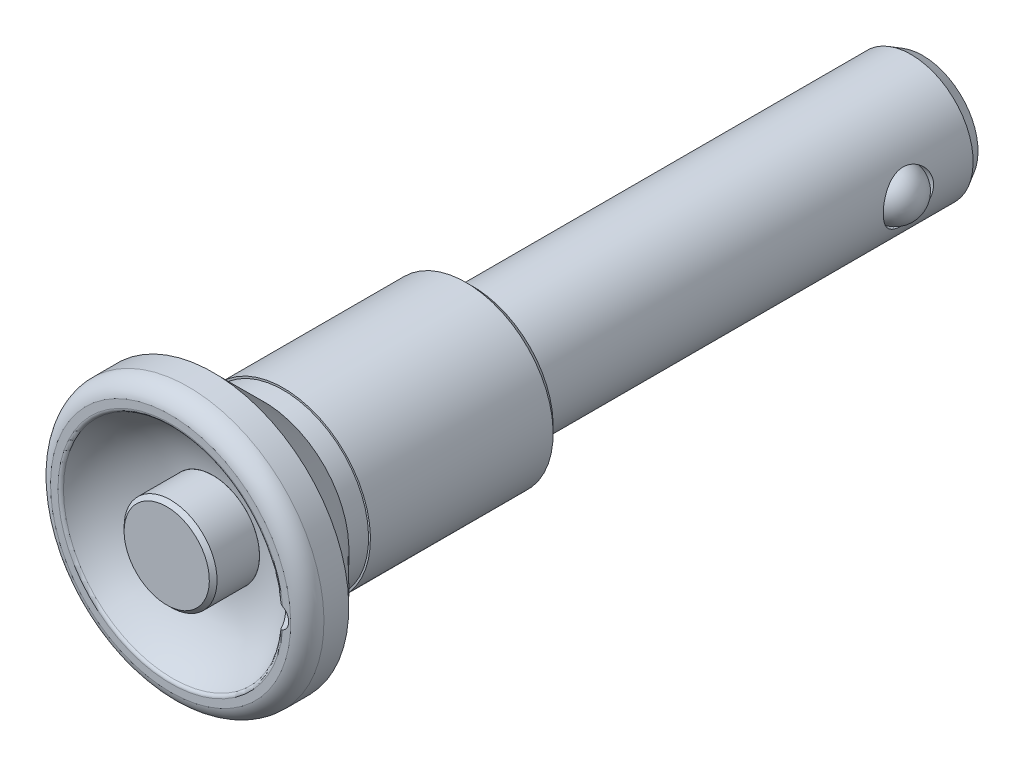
ISO-10303-21;
HEADER;
FILE_DESCRIPTION(('STEP AP214'),'2;1');
FILE_NAME('part.step','',(''),(''),'','','');
FILE_SCHEMA(('AUTOMOTIVE_DESIGN { 1 0 10303 214 1 1 1 1 }'));
ENDSEC;
DATA;
#1=APPLICATION_CONTEXT('core data for automotive mechanical design processes');
#2=APPLICATION_PROTOCOL_DEFINITION('international standard','automotive_design',2000,#1);
#3=PRODUCT_CONTEXT('',#1,'mechanical');
#4=PRODUCT('Part','Part','',(#3));
#5=PRODUCT_RELATED_PRODUCT_CATEGORY('part','',(#4));
#6=PRODUCT_DEFINITION_FORMATION('','',#4);
#7=PRODUCT_DEFINITION_CONTEXT('part definition',#1,'design');
#8=PRODUCT_DEFINITION('design','',#6,#7);
#9=PRODUCT_DEFINITION_SHAPE('','',#8);
#10=(LENGTH_UNIT() NAMED_UNIT(*) SI_UNIT(.MILLI.,.METRE.));
#11=(NAMED_UNIT(*) PLANE_ANGLE_UNIT() SI_UNIT($,.RADIAN.));
#12=(NAMED_UNIT(*) SI_UNIT($,.STERADIAN.) SOLID_ANGLE_UNIT());
#13=UNCERTAINTY_MEASURE_WITH_UNIT(LENGTH_MEASURE(1.E-05),#10,'distance_accuracy_value','');
#14=(GEOMETRIC_REPRESENTATION_CONTEXT(3) GLOBAL_UNCERTAINTY_ASSIGNED_CONTEXT((#13)) GLOBAL_UNIT_ASSIGNED_CONTEXT((#10,
#11,#12)) REPRESENTATION_CONTEXT('',''));
#15=CARTESIAN_POINT('',(0.,0.,0.));
#16=DIRECTION('',(0.,0.,1.));
#17=DIRECTION('',(1.,0.,0.));
#18=AXIS2_PLACEMENT_3D('',#15,#16,#17);
#19=CARTESIAN_POINT('',(9.,0.,-48.25));
#20=DIRECTION('',(1.,0.,0.));
#21=DIRECTION('',(0.,1.,0.));
#22=AXIS2_PLACEMENT_3D('',#19,#20,#21);
#23=CYLINDRICAL_SURFACE('',#22,3.25);
#24=CARTESIAN_POINT('',(-5.63465480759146,3.25,-48.25));
#25=CARTESIAN_POINT('',(-5.63465585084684,3.24999903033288,-48.3347265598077));
#26=CARTESIAN_POINT('',(-5.63657454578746,3.24668003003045,-48.4194635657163));
#27=CARTESIAN_POINT('',(-5.64416687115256,3.23345980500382,-48.5882644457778));
#28=CARTESIAN_POINT('',(-5.64984225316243,3.22355550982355,-48.6723279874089));
#29=CARTESIAN_POINT('',(-5.67225088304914,3.1840842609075,-48.9227685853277));
#30=CARTESIAN_POINT('',(-5.6943660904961,3.14475922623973,-49.0872467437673));
#31=CARTESIAN_POINT('',(-5.74975810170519,3.04227249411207,-49.4053993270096));
#32=CARTESIAN_POINT('',(-5.78297553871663,2.97923736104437,-49.5591260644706));
#33=CARTESIAN_POINT('',(-5.85672343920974,2.8315067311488,-49.8538197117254));
#34=CARTESIAN_POINT('',(-5.89725428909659,2.74681008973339,-49.994785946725));
#35=CARTESIAN_POINT('',(-5.98514477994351,2.54998143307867,-50.2727307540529));
#36=CARTESIAN_POINT('',(-6.03279191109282,2.4361644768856,-50.4084249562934));
#37=CARTESIAN_POINT('',(-6.12722511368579,2.18783002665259,-50.6597995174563));
#38=CARTESIAN_POINT('',(-6.17401074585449,2.05330228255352,-50.7754699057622));
#39=CARTESIAN_POINT('',(-6.26521517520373,1.75630332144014,-50.9911271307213));
#40=CARTESIAN_POINT('',(-6.30926291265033,1.59256097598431,-51.0895350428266));
#41=CARTESIAN_POINT('',(-6.38629670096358,1.24823211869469,-51.2568223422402));
#42=CARTESIAN_POINT('',(-6.41928971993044,1.06765630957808,-51.3257203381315));
#43=CARTESIAN_POINT('',(-6.46842511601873,0.70838520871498,-51.426948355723));
#44=CARTESIAN_POINT('',(-6.48559839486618,0.530468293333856,-51.4615292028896));
#45=CARTESIAN_POINT('',(-6.50500792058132,0.17059293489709,-51.5005535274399));
#46=CARTESIAN_POINT('',(-6.50725319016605,-0.0113630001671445,-51.5050152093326));
#47=CARTESIAN_POINT('',(-6.49704272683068,-0.35723022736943,-51.4845439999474));
#48=CARTESIAN_POINT('',(-6.4858466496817,-0.52133639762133,-51.462129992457));
#49=CARTESIAN_POINT('',(-6.45191454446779,-0.843095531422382,-51.3930510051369));
#50=CARTESIAN_POINT('',(-6.42917765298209,-1.00074801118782,-51.3463842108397));
#51=CARTESIAN_POINT('',(-6.37385308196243,-1.30787680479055,-51.2298199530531));
#52=CARTESIAN_POINT('',(-6.3411333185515,-1.45720962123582,-51.1596096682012));
#53=CARTESIAN_POINT('',(-6.26879358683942,-1.7423345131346,-50.9983862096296));
#54=CARTESIAN_POINT('',(-6.22917114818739,-1.8781217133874,-50.907365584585));
#55=CARTESIAN_POINT('',(-6.14233091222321,-2.14598519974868,-50.6972203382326));
#56=CARTESIAN_POINT('',(-6.09474919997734,-2.27650038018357,-50.5762535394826));
#57=CARTESIAN_POINT('',(-5.99975905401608,-2.51622424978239,-50.3146223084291));
#58=CARTESIAN_POINT('',(-5.95235078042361,-2.62541658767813,-50.1739429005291));
#59=CARTESIAN_POINT('',(-5.85980562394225,-2.82622074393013,-49.8657980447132));
#60=CARTESIAN_POINT('',(-5.81500282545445,-2.91628088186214,-49.6972003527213));
#61=CARTESIAN_POINT('',(-5.75683713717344,-3.02860289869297,-49.4329042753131));
#62=CARTESIAN_POINT('',(-5.73895226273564,-3.06225341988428,-49.3428861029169));
#63=CARTESIAN_POINT('',(-5.70689630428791,-3.12158760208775,-49.1596398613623));
#64=CARTESIAN_POINT('',(-5.69272293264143,-3.14727617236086,-49.0664138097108));
#65=CARTESIAN_POINT('',(-5.66966031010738,-3.18862076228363,-48.8849536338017));
#66=CARTESIAN_POINT('',(-5.66044290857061,-3.2049073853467,-48.7969042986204));
#67=CARTESIAN_POINT('',(-5.64606365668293,-3.23017214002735,-48.6194752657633));
#68=CARTESIAN_POINT('',(-5.64089969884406,-3.23915406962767,-48.5300962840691));
#69=CARTESIAN_POINT('',(-5.63484456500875,-3.24967714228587,-48.3507836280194));
#70=CARTESIAN_POINT('',(-5.63395180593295,-3.25122104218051,-48.2608501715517));
#71=CARTESIAN_POINT('',(-5.63646392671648,-3.24686086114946,-48.0812524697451));
#72=CARTESIAN_POINT('',(-5.63986851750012,-3.24095728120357,-47.9915882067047));
#73=CARTESIAN_POINT('',(-5.65514884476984,-3.21427724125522,-47.7437015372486));
#74=CARTESIAN_POINT('',(-5.67155983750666,-3.1854932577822,-47.5865355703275));
#75=CARTESIAN_POINT('',(-5.71556614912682,-3.10582623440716,-47.2796654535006));
#76=CARTESIAN_POINT('',(-5.74316508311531,-3.05493605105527,-47.1299637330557));
#77=CARTESIAN_POINT('',(-5.80791715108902,-2.93003236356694,-46.8342513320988));
#78=CARTESIAN_POINT('',(-5.84545364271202,-2.85505691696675,-46.6887328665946));
#79=CARTESIAN_POINT('',(-5.92551444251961,-2.68494755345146,-46.4115097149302));
#80=CARTESIAN_POINT('',(-5.96804130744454,-2.58980328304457,-46.2798121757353));
#81=CARTESIAN_POINT('',(-6.0597218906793,-2.36806394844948,-46.0166221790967));
#82=CARTESIAN_POINT('',(-6.10903611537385,-2.23901784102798,-45.8872408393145));
#83=CARTESIAN_POINT('',(-6.20410028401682,-1.96026914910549,-45.6513088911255));
#84=CARTESIAN_POINT('',(-6.24984902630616,-1.81055964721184,-45.5447659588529));
#85=CARTESIAN_POINT('',(-6.33418834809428,-1.48934321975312,-45.3551748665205));
#86=CARTESIAN_POINT('',(-6.3725595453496,-1.31736733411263,-45.272816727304));
#87=CARTESIAN_POINT('',(-6.43615086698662,-0.959533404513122,-45.1390207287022));
#88=CARTESIAN_POINT('',(-6.46138252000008,-0.773687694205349,-45.0875557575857));
#89=CARTESIAN_POINT('',(-6.49401408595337,-0.411781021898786,-45.0214370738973));
#90=CARTESIAN_POINT('',(-6.50283657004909,-0.236384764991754,-45.0038414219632));
#91=CARTESIAN_POINT('',(-6.50610717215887,0.11505074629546,-44.9972911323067));
#92=CARTESIAN_POINT('',(-6.50056030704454,0.291089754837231,-45.0083264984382));
#93=CARTESIAN_POINT('',(-6.47654468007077,0.62662898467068,-45.0567749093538));
#94=CARTESIAN_POINT('',(-6.4589493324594,0.786455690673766,-45.0924062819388));
#95=CARTESIAN_POINT('',(-6.41341105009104,1.09760306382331,-45.1866353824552));
#96=CARTESIAN_POINT('',(-6.38546662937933,1.24892250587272,-45.2452364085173));
#97=CARTESIAN_POINT('',(-6.32026378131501,1.54603651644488,-45.3863521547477));
#98=CARTESIAN_POINT('',(-6.28265782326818,1.69131721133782,-45.4697832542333));
#99=CARTESIAN_POINT('',(-6.20206440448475,1.96642117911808,-45.6570473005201));
#100=CARTESIAN_POINT('',(-6.15907447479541,2.09623730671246,-45.7608896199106));
#101=CARTESIAN_POINT('',(-6.06695065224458,2.35031327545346,-45.9979647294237));
#102=CARTESIAN_POINT('',(-6.01763078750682,2.47273842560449,-46.1330928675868));
#103=CARTESIAN_POINT('',(-5.92193632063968,2.69389263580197,-46.4228073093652));
#104=CARTESIAN_POINT('',(-5.87556434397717,2.79260078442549,-46.5774106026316));
#105=CARTESIAN_POINT('',(-5.81174828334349,2.92195709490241,-46.8239315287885));
#106=CARTESIAN_POINT('',(-5.7911601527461,2.96243340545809,-46.91000421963));
#107=CARTESIAN_POINT('',(-5.75300321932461,3.03586895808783,-47.0859253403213));
#108=CARTESIAN_POINT('',(-5.73543286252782,3.0688320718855,-47.175771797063));
#109=CARTESIAN_POINT('',(-5.70405555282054,3.1267666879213,-47.3583807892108));
#110=CARTESIAN_POINT('',(-5.69023892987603,3.15175875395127,-47.4511351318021));
#111=CARTESIAN_POINT('',(-5.66692413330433,3.19349036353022,-47.6389664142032));
#112=CARTESIAN_POINT('',(-5.65742293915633,3.21023567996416,-47.7340416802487));
#113=CARTESIAN_POINT('',(-5.64512882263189,3.23178897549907,-47.8993457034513));
#114=CARTESIAN_POINT('',(-5.6412106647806,3.23861149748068,-47.9692357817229));
#115=CARTESIAN_POINT('',(-5.63597313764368,3.24771756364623,-48.1094148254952));
#116=CARTESIAN_POINT('',(-5.63465394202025,3.25000080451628,-48.1797038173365));
#117=CARTESIAN_POINT('',(-5.63465480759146,3.25,-48.25));
#118=B_SPLINE_CURVE_WITH_KNOTS('',3,(#24,#25,#26,#27,#28,#29,#30,#31,#32,#33,#34,#35,#36,#37,
#38,#39,#40,#41,#42,#43,#44,#45,#46,#47,#48,#49,#50,#51,#52,#53,#54,#55,#56,#57,#58,#59,#60,#61,
#62,#63,#64,#65,#66,#67,#68,#69,#70,#71,#72,#73,#74,#75,#76,#77,#78,#79,#80,#81,#82,#83,#84,#85,
#86,#87,#88,#89,#90,#91,#92,#93,#94,#95,#96,#97,#98,#99,#100,#101,#102,#103,#104,#105,#106,#107,
#108,#109,#110,#111,#112,#113,#114,#115,#116,#117),.UNSPECIFIED.,.T.,.F.,(4,2,2,2,2,2,2,2,2,2,2,
2,2,2,2,2,2,2,2,2,2,2,2,2,2,2,2,2,2,2,2,2,2,2,2,2,2,2,2,2,2,2,2,2,2,2,4),(0.,0.254102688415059,
0.508323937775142,1.01720671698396,1.52341076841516,2.0296415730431,2.57756086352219,
3.1257522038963,3.71082834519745,4.29553499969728,4.8386878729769,5.38151242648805,
5.87719988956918,6.37292444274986,6.87551542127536,7.37828663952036,7.92853225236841,
8.4791981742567,9.06474424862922,9.35763698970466,9.65034877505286,9.9200168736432,
10.1895446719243,10.4589725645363,10.7283823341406,11.2078563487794,11.6874854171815,
12.189332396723,12.6914376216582,13.2567245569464,13.8222011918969,14.4025190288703,
14.982326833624,15.5089851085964,16.0354595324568,16.5273252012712,17.0192615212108,
17.5322584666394,18.045491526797,18.6097361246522,19.1744764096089,19.4660899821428,
19.7575529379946,20.0482577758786,20.3387588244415,20.5495694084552,20.7603940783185),.UNSPECIFIED.);
#119=CARTESIAN_POINT('',(-6.04146080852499,-2.41093054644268,-50.429429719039));
#120=VERTEX_POINT('',#119);
#121=CARTESIAN_POINT('',(-6.04146080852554,2.41093054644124,-50.4294297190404));
#122=VERTEX_POINT('',#121);
#123=EDGE_CURVE('E78',#120,#122,#118,.T.);
#124=ORIENTED_EDGE('',*,*,#123,.F.);
#125=CARTESIAN_POINT('',(-6.50475478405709,0.,-51.5));
#126=CARTESIAN_POINT('',(-6.50475472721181,-0.182431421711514,-51.4999918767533));
#127=CARTESIAN_POINT('',(-6.50415200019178,-0.364995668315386,-51.4845876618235));
#128=CARTESIAN_POINT('',(-6.50173100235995,-0.725096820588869,-51.4233526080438));
#129=CARTESIAN_POINT('',(-6.49991125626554,-0.902627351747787,-51.3774848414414));
#130=CARTESIAN_POINT('',(-6.49502786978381,-1.24739374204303,-51.2566336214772));
#131=CARTESIAN_POINT('',(-6.49196480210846,-1.41463430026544,-51.1816635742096));
#132=CARTESIAN_POINT('',(-6.48454055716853,-1.7340906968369,-51.0047703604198));
#133=CARTESIAN_POINT('',(-6.48017978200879,-1.88631116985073,-50.9028555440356));
#134=CARTESIAN_POINT('',(-6.47005616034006,-2.17150162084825,-50.6749545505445));
#135=CARTESIAN_POINT('',(-6.46429309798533,-2.30446863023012,-50.5489646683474));
#136=CARTESIAN_POINT('',(-6.45117895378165,-2.54740669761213,-50.2764608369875));
#137=CARTESIAN_POINT('',(-6.44382727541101,-2.65736908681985,-50.1299391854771));
#138=CARTESIAN_POINT('',(-6.42714023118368,-2.8512229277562,-49.8204831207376));
#139=CARTESIAN_POINT('',(-6.41780288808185,-2.93508818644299,-49.6575324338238));
#140=CARTESIAN_POINT('',(-6.39637595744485,-3.07415122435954,-49.3201765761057));
#141=CARTESIAN_POINT('',(-6.38429049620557,-3.12939158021,-49.1457888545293));
#142=CARTESIAN_POINT('',(-6.36213145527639,-3.18943231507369,-48.8809438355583));
#143=CARTESIAN_POINT('',(-6.35414445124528,-3.20560626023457,-48.7927604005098));
#144=CARTESIAN_POINT('',(-6.33542581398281,-3.23060141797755,-48.6156617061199));
#145=CARTESIAN_POINT('',(-6.32469468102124,-3.239423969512,-48.5267465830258));
#146=CARTESIAN_POINT('',(-6.30342598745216,-3.24711535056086,-48.3937912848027));
#147=CARTESIAN_POINT('',(-6.29549176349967,-3.24875723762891,-48.3496150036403));
#148=CARTESIAN_POINT('',(-6.27882947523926,-3.24969197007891,-48.2959956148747));
#149=CARTESIAN_POINT('',(-6.2751577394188,-3.24982305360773,-48.2853466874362));
#150=CARTESIAN_POINT('',(-6.2689001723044,-3.24992109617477,-48.2727940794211));
#151=CARTESIAN_POINT('',(-6.26755615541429,-3.24993748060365,-48.2703066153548));
#152=CARTESIAN_POINT('',(-6.2645775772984,-3.24996385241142,-48.2655076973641));
#153=CARTESIAN_POINT('',(-6.26294427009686,-3.24997386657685,-48.2631955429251));
#154=CARTESIAN_POINT('',(-6.26029966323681,-3.2499838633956,-48.2602771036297));
#155=CARTESIAN_POINT('',(-6.259503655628,-3.24998625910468,-48.2594800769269));
#156=CARTESIAN_POINT('',(-6.25780472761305,-3.24999021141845,-48.2580094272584));
#157=CARTESIAN_POINT('',(-6.25690222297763,-3.24999177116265,-48.2573353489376));
#158=CARTESIAN_POINT('',(-6.2553817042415,-3.24999365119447,-48.2564327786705));
#159=CARTESIAN_POINT('',(-6.25480452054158,-3.2499942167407,-48.2561363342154));
#160=CARTESIAN_POINT('',(-6.25361148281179,-3.2499951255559,-48.2556343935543));
#161=CARTESIAN_POINT('',(-6.25299567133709,-3.24999546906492,-48.2554287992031));
#162=CARTESIAN_POINT('',(-6.25172949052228,-3.2499959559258,-48.2551293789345));
#163=CARTESIAN_POINT('',(-6.25107882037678,-3.24999609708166,-48.2550367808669));
#164=CARTESIAN_POINT('',(-6.24977202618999,-3.24999618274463,-48.2549813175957));
#165=CARTESIAN_POINT('',(-6.24911590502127,-3.24999612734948,-48.2550183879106));
#166=CARTESIAN_POINT('',(-6.24790373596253,-3.24999583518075,-48.2552035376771));
#167=CARTESIAN_POINT('',(-6.2473453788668,-3.24999562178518,-48.2553372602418));
#168=CARTESIAN_POINT('',(-6.2462549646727,-3.24999503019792,-48.2556861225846));
#169=CARTESIAN_POINT('',(-6.24572292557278,-3.24999465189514,-48.2559013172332));
#170=CARTESIAN_POINT('',(-6.24435696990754,-3.24999341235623,-48.2565561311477));
#171=CARTESIAN_POINT('',(-6.24354975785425,-3.24999239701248,-48.2570509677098));
#172=CARTESIAN_POINT('',(-6.24201857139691,-3.24998981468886,-48.2581558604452));
#173=CARTESIAN_POINT('',(-6.24129488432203,-3.24998824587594,-48.2587662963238));
#174=CARTESIAN_POINT('',(-6.23885580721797,-3.24998160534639,-48.2610537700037));
#175=CARTESIAN_POINT('',(-6.23732819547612,-3.24997485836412,-48.2629265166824));
#176=CARTESIAN_POINT('',(-6.23453858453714,-3.24995689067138,-48.2668604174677));
#177=CARTESIAN_POINT('',(-6.23327848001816,-3.24994563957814,-48.2689227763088));
#178=CARTESIAN_POINT('',(-6.22754077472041,-3.24987933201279,-48.2791362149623));
#179=CARTESIAN_POINT('',(-6.22414293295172,-3.24979089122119,-48.2878680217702));
#180=CARTESIAN_POINT('',(-6.21809518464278,-3.24953787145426,-48.3055431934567));
#181=CARTESIAN_POINT('',(-6.21544772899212,-3.24937304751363,-48.3144871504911));
#182=CARTESIAN_POINT('',(-6.20329024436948,-3.24836406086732,-48.359005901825));
#183=CARTESIAN_POINT('',(-6.19656627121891,-3.24694993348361,-48.3953332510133));
#184=CARTESIAN_POINT('',(-6.18452276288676,-3.24287823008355,-48.4681644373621));
#185=CARTESIAN_POINT('',(-6.1792084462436,-3.24021613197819,-48.5046684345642));
#186=CARTESIAN_POINT('',(-6.16455650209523,-3.23031427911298,-48.6146776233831));
#187=CARTESIAN_POINT('',(-6.15659209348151,-3.22116857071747,-48.688230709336));
#188=CARTESIAN_POINT('',(-6.14213641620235,-3.19786349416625,-48.8345240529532));
#189=CARTESIAN_POINT('',(-6.1356431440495,-3.1837110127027,-48.907265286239));
#190=CARTESIAN_POINT('',(-6.11756290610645,-3.13371051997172,-49.1243002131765));
#191=CARTESIAN_POINT('',(-6.10741258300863,-3.09035068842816,-49.2670577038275));
#192=CARTESIAN_POINT('',(-6.08705596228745,-2.97250185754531,-49.5766439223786));
#193=CARTESIAN_POINT('',(-6.07734814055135,-2.89321109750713,-49.7416864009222));
#194=CARTESIAN_POINT('',(-6.06000127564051,-2.70803402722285,-50.0561997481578));
#195=CARTESIAN_POINT('',(-6.05236213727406,-2.60214894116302,-50.2056713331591));
#196=CARTESIAN_POINT('',(-6.03871394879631,-2.36675113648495,-50.484797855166));
#197=CARTESIAN_POINT('',(-6.03270506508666,-2.23723600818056,-50.6144507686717));
#198=CARTESIAN_POINT('',(-6.02211352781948,-1.95825322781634,-50.8502113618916));
#199=CARTESIAN_POINT('',(-6.01753088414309,-1.80878543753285,-50.9563188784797));
#200=CARTESIAN_POINT('',(-6.00967850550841,-1.4941417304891,-51.1419551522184));
#201=CARTESIAN_POINT('',(-6.00640873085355,-1.32896628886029,-51.2214847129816));
#202=CARTESIAN_POINT('',(-6.00112064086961,-0.987593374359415,-51.3516982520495));
#203=CARTESIAN_POINT('',(-5.99910232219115,-0.811395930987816,-51.4023823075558));
#204=CARTESIAN_POINT('',(-5.99628586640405,-0.453052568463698,-51.4734446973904));
#205=CARTESIAN_POINT('',(-5.99548726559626,-0.270908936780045,-51.4938345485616));
#206=CARTESIAN_POINT('',(-5.99509745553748,0.0942183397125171,-51.5037635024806));
#207=CARTESIAN_POINT('',(-5.99550624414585,0.277201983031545,-51.4933026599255));
#208=CARTESIAN_POINT('',(-5.99753672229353,0.638781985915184,-51.4418331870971));
#209=CARTESIAN_POINT('',(-5.9991582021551,0.817379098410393,-51.4008298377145));
#210=CARTESIAN_POINT('',(-6.00363843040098,1.16515467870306,-51.2894496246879));
#211=CARTESIAN_POINT('',(-6.00649721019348,1.33433290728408,-51.2190720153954));
#212=CARTESIAN_POINT('',(-6.0135025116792,1.65849568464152,-51.0509346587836));
#213=CARTESIAN_POINT('',(-6.01764926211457,1.81347770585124,-50.9531700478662));
#214=CARTESIAN_POINT('',(-6.0273234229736,2.1047933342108,-50.7330763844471));
#215=CARTESIAN_POINT('',(-6.03285058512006,2.24113028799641,-50.6107517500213));
#216=CARTESIAN_POINT('',(-6.04544982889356,2.49132905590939,-50.3450117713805));
#217=CARTESIAN_POINT('',(-6.05252187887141,2.60519133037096,-50.2015968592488));
#218=CARTESIAN_POINT('',(-6.06857069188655,2.8073171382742,-49.8976741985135));
#219=CARTESIAN_POINT('',(-6.07754918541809,2.8955572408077,-49.7371509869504));
#220=CARTESIAN_POINT('',(-6.09807707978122,3.04397016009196,-49.4033061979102));
#221=CARTESIAN_POINT('',(-6.10963108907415,3.10409205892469,-49.2299620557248));
#222=CARTESIAN_POINT('',(-6.13064936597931,3.17169375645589,-48.9649701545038));
#223=CARTESIAN_POINT('',(-6.13825974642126,3.19045596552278,-48.8759096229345));
#224=CARTESIAN_POINT('',(-6.15556946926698,3.22042544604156,-48.6967504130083));
#225=CARTESIAN_POINT('',(-6.16526748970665,3.23163748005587,-48.6066524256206));
#226=CARTESIAN_POINT('',(-6.18408699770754,3.24288271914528,-48.4699792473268));
#227=CARTESIAN_POINT('',(-6.19122596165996,3.24569959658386,-48.4233942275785));
#228=CARTESIAN_POINT('',(-6.20522823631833,3.24841427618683,-48.3541203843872));
#229=CARTESIAN_POINT('',(-6.21044556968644,3.24906738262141,-48.3311266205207));
#230=CARTESIAN_POINT('',(-6.22071764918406,3.24967689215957,-48.2971645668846));
#231=CARTESIAN_POINT('',(-6.22455261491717,3.24981834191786,-48.2859249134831));
#232=CARTESIAN_POINT('',(-6.23115042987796,3.24992193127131,-48.2726935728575));
#233=CARTESIAN_POINT('',(-6.23257343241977,3.24993908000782,-48.2700667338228));
#234=CARTESIAN_POINT('',(-6.23574861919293,3.249966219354,-48.2650204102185));
#235=CARTESIAN_POINT('',(-6.23749823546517,3.24997626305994,-48.262599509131));
#236=CARTESIAN_POINT('',(-6.24023323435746,3.24998546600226,-48.2597477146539));
#237=CARTESIAN_POINT('',(-6.24095037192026,3.24998741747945,-48.2590662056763));
#238=CARTESIAN_POINT('',(-6.24247036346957,3.2499906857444,-48.2578055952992));
#239=CARTESIAN_POINT('',(-6.24327303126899,3.24999200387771,-48.2572262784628));
#240=CARTESIAN_POINT('',(-6.24469100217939,3.24999372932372,-48.2563932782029));
#241=CARTESIAN_POINT('',(-6.24527994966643,3.24999429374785,-48.25609535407));
#242=CARTESIAN_POINT('',(-6.24649738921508,3.24999519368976,-48.25559494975));
#243=CARTESIAN_POINT('',(-6.24712582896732,3.24999552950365,-48.2553923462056));
#244=CARTESIAN_POINT('',(-6.24841731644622,3.24999599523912,-48.2551042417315));
#245=CARTESIAN_POINT('',(-6.24908067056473,3.24999612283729,-48.2550200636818));
#246=CARTESIAN_POINT('',(-6.25041071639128,3.24999617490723,-48.2549864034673));
#247=CARTESIAN_POINT('',(-6.25107740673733,3.24999609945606,-48.2550368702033));
#248=CARTESIAN_POINT('',(-6.2522960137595,3.24999576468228,-48.2552474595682));
#249=CARTESIAN_POINT('',(-6.25285091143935,3.24999553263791,-48.2553912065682));
#250=CARTESIAN_POINT('',(-6.2539333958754,3.24999490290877,-48.2557583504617));
#251=CARTESIAN_POINT('',(-6.25446096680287,3.24999450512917,-48.25598179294));
#252=CARTESIAN_POINT('',(-6.25583840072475,3.24999318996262,-48.256667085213));
#253=CARTESIAN_POINT('',(-6.256659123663,3.24999210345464,-48.2571869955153));
#254=CARTESIAN_POINT('',(-6.2582140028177,3.24998934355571,-48.2583432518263));
#255=CARTESIAN_POINT('',(-6.2589478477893,3.24998766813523,-48.2589799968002));
#256=CARTESIAN_POINT('',(-6.26145971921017,3.24998046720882,-48.2613987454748));
#257=CARTESIAN_POINT('',(-6.2630348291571,3.2499730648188,-48.2633865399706));
#258=CARTESIAN_POINT('',(-6.26590679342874,3.24995329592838,-48.2675538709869));
#259=CARTESIAN_POINT('',(-6.26720163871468,3.24994089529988,-48.2697346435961));
#260=CARTESIAN_POINT('',(-6.27320326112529,3.24986641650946,-48.2807202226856));
#261=CARTESIAN_POINT('',(-6.27673982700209,3.24976552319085,-48.2901364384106));
#262=CARTESIAN_POINT('',(-6.28303094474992,3.24947572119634,-48.3091775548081));
#263=CARTESIAN_POINT('',(-6.28578309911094,3.24928654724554,-48.3188030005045));
#264=CARTESIAN_POINT('',(-6.29841795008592,3.24812694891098,-48.3667085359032));
#265=CARTESIAN_POINT('',(-6.30538389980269,3.24649816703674,-48.4057506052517));
#266=CARTESIAN_POINT('',(-6.31786268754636,3.2418065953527,-48.4839948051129));
#267=CARTESIAN_POINT('',(-6.32337031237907,3.23873876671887,-48.5231970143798));
#268=CARTESIAN_POINT('',(-6.33857182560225,3.22731083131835,-48.6414665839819));
#269=CARTESIAN_POINT('',(-6.34682941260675,3.21674112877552,-48.7205459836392));
#270=CARTESIAN_POINT('',(-6.36180806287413,3.18980788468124,-48.8776933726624));
#271=CARTESIAN_POINT('',(-6.36853100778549,3.17345150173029,-48.9557624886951));
#272=CARTESIAN_POINT('',(-6.38722831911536,3.11568291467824,-49.1883617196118));
#273=CARTESIAN_POINT('',(-6.39769866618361,3.0656017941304,-49.3409675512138));
#274=CARTESIAN_POINT('',(-6.41649095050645,2.94356822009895,-49.6369097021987));
#275=CARTESIAN_POINT('',(-6.42481661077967,2.87165414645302,-49.7802617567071));
#276=CARTESIAN_POINT('',(-6.4398810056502,2.70750791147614,-50.0548470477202));
#277=CARTESIAN_POINT('',(-6.44662026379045,2.61528247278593,-50.1860842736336));
#278=CARTESIAN_POINT('',(-6.45968563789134,2.39819149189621,-50.4510135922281));
#279=CARTESIAN_POINT('',(-6.46582082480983,2.27056101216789,-50.58246220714));
#280=CARTESIAN_POINT('',(-6.47665599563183,1.99493696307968,-50.82218121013));
#281=CARTESIAN_POINT('',(-6.4813549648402,1.84692910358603,-50.9304351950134));
#282=CARTESIAN_POINT('',(-6.4894329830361,1.53479241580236,-51.1205971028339));
#283=CARTESIAN_POINT('',(-6.49281172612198,1.37065986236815,-51.2024989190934));
#284=CARTESIAN_POINT('',(-6.49830922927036,1.03110256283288,-51.3374958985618));
#285=CARTESIAN_POINT('',(-6.50042961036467,0.85569266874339,-51.3906281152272));
#286=CARTESIAN_POINT('',(-6.50287966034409,0.565964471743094,-51.4523665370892));
#287=CARTESIAN_POINT('',(-6.50358302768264,0.453533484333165,-51.4702066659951));
#288=CARTESIAN_POINT('',(-6.50452060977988,0.227418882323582,-51.4940259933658));
#289=CARTESIAN_POINT('',(-6.50475481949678,0.113735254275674,-51.5000050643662));
#290=CARTESIAN_POINT('',(-6.50475478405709,0.,-51.5));
#291=B_SPLINE_CURVE_WITH_KNOTS('',3,(#125,#126,#127,#128,#129,#130,#131,#132,#133,#134,#135,
#136,#137,#138,#139,#140,#141,#142,#143,#144,#145,#146,#147,#148,#149,#150,#151,#152,#153,#154,
#155,#156,#157,#158,#159,#160,#161,#162,#163,#164,#165,#166,#167,#168,#169,#170,#171,#172,#173,
#174,#175,#176,#177,#178,#179,#180,#181,#182,#183,#184,#185,#186,#187,#188,#189,#190,#191,#192,
#193,#194,#195,#196,#197,#198,#199,#200,#201,#202,#203,#204,#205,#206,#207,#208,#209,#210,#211,
#212,#213,#214,#215,#216,#217,#218,#219,#220,#221,#222,#223,#224,#225,#226,#227,#228,#229,#230,
#231,#232,#233,#234,#235,#236,#237,#238,#239,#240,#241,#242,#243,#244,#245,#246,#247,#248,#249,
#250,#251,#252,#253,#254,#255,#256,#257,#258,#259,#260,#261,#262,#263,#264,#265,#266,#267,#268,
#269,#270,#271,#272,#273,#274,#275,#276,#277,#278,#279,#280,#281,#282,#283,#284,#285,#286,#287,
#288,#289,#290),.UNSPECIFIED.,.T.,.F.,(4,2,2,2,2,2,2,2,2,2,2,2,2,2,2,2,2,2,2,2,2,2,2,2,2,2,2,2,
2,2,2,2,2,2,2,2,2,2,2,2,2,2,2,2,2,2,2,2,2,2,2,2,2,2,2,2,2,2,2,2,2,2,2,2,2,2,2,2,2,2,2,2,2,2,2,2,
2,2,2,2,2,2,4),(0.,0.546878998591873,1.09442213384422,1.64171333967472,2.18883513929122,
2.73604120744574,3.28345310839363,3.83141267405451,4.37855484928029,4.64829359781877,
4.91798320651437,5.05238497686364,5.08600715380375,5.0944820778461,5.10292112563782,
5.1062935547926,5.10965322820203,5.11159396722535,5.11353260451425,5.11549212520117,
5.11745067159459,5.11916600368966,5.12088249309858,5.12370644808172,5.12653984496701,
5.13373370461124,5.14097693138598,5.16888967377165,5.1968925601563,5.30747569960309,
5.41846267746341,5.64180446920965,5.86484024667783,6.31195514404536,6.85939401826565,
7.40680769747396,7.95427723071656,8.50175055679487,9.04920732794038,9.59666263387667,
10.1439097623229,10.6911559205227,11.2383074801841,11.7854729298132,12.3327356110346,
12.879899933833,13.427053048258,13.9747049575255,14.5233447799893,14.7970709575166,
15.0706243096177,15.2120965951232,15.2828520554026,15.3182754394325,15.3272316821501,
15.3361202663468,15.3390824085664,15.3420382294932,15.3440119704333,15.3459831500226,
15.3479761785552,15.3499684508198,15.3516812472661,15.3533950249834,15.3562927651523,
15.3592005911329,15.3667496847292,15.3743512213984,15.4043178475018,15.4343751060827,
15.5531053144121,15.672254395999,15.912531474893,16.1525123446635,16.6334226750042,
17.1134924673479,17.5934036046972,18.1407106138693,18.688403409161,19.2362230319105,
19.7833354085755,20.1242786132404,20.465225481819),.UNSPECIFIED.);
#292=EDGE_CURVE('E62',#122,#120,#291,.T.);
#293=ORIENTED_EDGE('',*,*,#292,.F.);
#294=EDGE_LOOP('',(#124,#293));
#295=FACE_BOUND('',#294,.T.);
#296=CARTESIAN_POINT('',(-7.31009575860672,3.25,-48.25));
#297=CARTESIAN_POINT('',(-7.31009732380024,3.24999819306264,-48.1630599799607));
#298=CARTESIAN_POINT('',(-7.31165386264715,3.24650411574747,-48.076090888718));
#299=CARTESIAN_POINT('',(-7.31782159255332,3.23257358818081,-47.9028024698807));
#300=CARTESIAN_POINT('',(-7.3224347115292,3.22213275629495,-47.8164835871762));
#301=CARTESIAN_POINT('',(-7.34068494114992,3.18046303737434,-47.5591175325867));
#302=CARTESIAN_POINT('',(-7.35873227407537,3.13888730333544,-47.3899262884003));
#303=CARTESIAN_POINT('',(-7.40417815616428,3.03010582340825,-47.0622642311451));
#304=CARTESIAN_POINT('',(-7.43153982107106,2.96300104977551,-46.9037540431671));
#305=CARTESIAN_POINT('',(-7.49246721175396,2.80536216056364,-46.6002509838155));
#306=CARTESIAN_POINT('',(-7.5260312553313,2.71483439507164,-46.4552544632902));
#307=CARTESIAN_POINT('',(-7.59780469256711,2.50719740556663,-46.174284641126));
#308=CARTESIAN_POINT('',(-7.63616661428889,2.38892405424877,-46.0392107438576));
#309=CARTESIAN_POINT('',(-7.71195570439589,2.13160039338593,-45.790151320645));
#310=CARTESIAN_POINT('',(-7.74938251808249,1.99254233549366,-45.6761736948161));
#311=CARTESIAN_POINT('',(-7.82092244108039,1.69061377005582,-45.4680431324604));
#312=CARTESIAN_POINT('',(-7.85483757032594,1.52700226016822,-45.3748909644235));
#313=CARTESIAN_POINT('',(-7.91367836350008,1.18480623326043,-45.2178173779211));
#314=CARTESIAN_POINT('',(-7.93860783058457,1.00622809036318,-45.1538835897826));
#315=CARTESIAN_POINT('',(-7.97558858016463,0.648594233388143,-45.0602869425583));
#316=CARTESIAN_POINT('',(-7.98821898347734,0.470004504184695,-45.0290769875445));
#317=CARTESIAN_POINT('',(-8.00127556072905,0.109705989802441,-44.9968257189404));
#318=CARTESIAN_POINT('',(-8.00170642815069,-0.0720015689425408,-44.9957728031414));
#319=CARTESIAN_POINT('',(-7.99066355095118,-0.422169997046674,-45.0230312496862));
#320=CARTESIAN_POINT('',(-7.97987772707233,-0.5907886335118,-45.0496457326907));
#321=CARTESIAN_POINT('',(-7.94854711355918,-0.920926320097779,-45.1285888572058));
#322=CARTESIAN_POINT('',(-7.92800160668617,-1.08244484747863,-45.1809193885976));
#323=CARTESIAN_POINT('',(-7.87875951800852,-1.39673026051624,-45.3104453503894));
#324=CARTESIAN_POINT('',(-7.84994411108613,-1.54932739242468,-45.3880056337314));
#325=CARTESIAN_POINT('',(-7.78700709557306,-1.83973693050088,-45.5654420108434));
#326=CARTESIAN_POINT('',(-7.75288364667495,-1.97754418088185,-45.6653258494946));
#327=CARTESIAN_POINT('',(-7.68006213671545,-2.2443353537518,-45.8924212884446));
#328=CARTESIAN_POINT('',(-7.6412107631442,-2.37209684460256,-46.0210218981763));
#329=CARTESIAN_POINT('',(-7.56507027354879,-2.60475126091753,-46.2979515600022));
#330=CARTESIAN_POINT('',(-7.52778170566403,-2.70963621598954,-46.4462874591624));
#331=CARTESIAN_POINT('',(-7.45792668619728,-2.89648137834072,-46.7641116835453));
#332=CARTESIAN_POINT('',(-7.42553491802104,-2.97766171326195,-46.9341001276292));
#333=CARTESIAN_POINT('',(-7.37120049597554,-3.10975325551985,-47.2870012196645));
#334=CARTESIAN_POINT('',(-7.34925080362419,-3.16068485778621,-47.4699050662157));
#335=CARTESIAN_POINT('',(-7.32000769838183,-3.22780941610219,-47.8312282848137));
#336=CARTESIAN_POINT('',(-7.31188362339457,-3.24597550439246,-48.009212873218));
#337=CARTESIAN_POINT('',(-7.30884184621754,-3.25282336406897,-48.365834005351));
#338=CARTESIAN_POINT('',(-7.31391993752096,-3.24151452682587,-48.544470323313));
#339=CARTESIAN_POINT('',(-7.33585566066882,-3.19153169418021,-48.8861339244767));
#340=CARTESIAN_POINT('',(-7.35199401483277,-3.15452692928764,-49.0494573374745));
#341=CARTESIAN_POINT('',(-7.39332962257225,-3.05638531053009,-49.3674592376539));
#342=CARTESIAN_POINT('',(-7.41852892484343,-2.99524299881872,-49.5221357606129));
#343=CARTESIAN_POINT('',(-7.47641704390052,-2.84775217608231,-49.8255746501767));
#344=CARTESIAN_POINT('',(-7.50937194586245,-2.76046786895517,-49.9738297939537));
#345=CARTESIAN_POINT('',(-7.57866264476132,-2.56411776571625,-50.2542780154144));
#346=CARTESIAN_POINT('',(-7.61499984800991,-2.4550428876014,-50.3864643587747));
#347=CARTESIAN_POINT('',(-7.69032288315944,-2.20834452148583,-50.6415580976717));
#348=CARTESIAN_POINT('',(-7.72929827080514,-2.06917373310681,-50.7629779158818));
#349=CARTESIAN_POINT('',(-7.80289864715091,-1.77151095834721,-50.980984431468));
#350=CARTESIAN_POINT('',(-7.83752340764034,-1.6130179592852,-51.0775698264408));
#351=CARTESIAN_POINT('',(-7.89867149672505,-1.28045225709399,-51.2428966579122));
#352=CARTESIAN_POINT('',(-7.9251887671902,-1.10636802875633,-51.311617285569));
#353=CARTESIAN_POINT('',(-7.9670167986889,-0.747763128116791,-51.4183263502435));
#354=CARTESIAN_POINT('',(-7.98233386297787,-0.563248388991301,-51.4563320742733));
#355=CARTESIAN_POINT('',(-7.99934332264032,-0.202353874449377,-51.4984343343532));
#356=CARTESIAN_POINT('',(-8.00187969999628,-0.0262571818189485,-51.5046318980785));
#357=CARTESIAN_POINT('',(-7.99534247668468,0.324389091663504,-51.4885273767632));
#358=CARTESIAN_POINT('',(-7.98627073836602,0.498938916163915,-51.4662298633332));
#359=CARTESIAN_POINT('',(-7.95796712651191,0.835717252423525,-51.3952733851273));
#360=CARTESIAN_POINT('',(-7.93907454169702,0.998161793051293,-51.3474934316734));
#361=CARTESIAN_POINT('',(-7.89317001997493,1.31268916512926,-51.2278639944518));
#362=CARTESIAN_POINT('',(-7.86615650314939,1.464769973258,-51.1560098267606));
#363=CARTESIAN_POINT('',(-7.80514921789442,1.76171759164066,-50.9866698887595));
#364=CARTESIAN_POINT('',(-7.77089769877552,1.90595939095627,-50.8881831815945));
#365=CARTESIAN_POINT('',(-7.69951725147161,2.17647386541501,-50.6698538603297));
#366=CARTESIAN_POINT('',(-7.66238732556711,2.30274026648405,-50.5500038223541));
#367=CARTESIAN_POINT('',(-7.5864657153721,2.54210677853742,-50.2833069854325));
#368=CARTESIAN_POINT('',(-7.54772000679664,2.65384474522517,-50.1352223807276));
#369=CARTESIAN_POINT('',(-7.47545536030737,2.85108049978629,-49.8210469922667));
#370=CARTESIAN_POINT('',(-7.44193927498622,2.93656399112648,-49.6549464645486));
#371=CARTESIAN_POINT('',(-7.39896255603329,3.04249490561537,-49.3964499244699));
#372=CARTESIAN_POINT('',(-7.38588609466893,3.0740182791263,-49.3090459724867));
#373=CARTESIAN_POINT('',(-7.36253208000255,3.12954209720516,-49.1315309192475));
#374=CARTESIAN_POINT('',(-7.35225317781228,3.15354616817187,-49.0414211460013));
#375=CARTESIAN_POINT('',(-7.3348971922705,3.19370630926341,-48.8594307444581));
#376=CARTESIAN_POINT('',(-7.32781154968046,3.20988336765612,-48.7675555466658));
#377=CARTESIAN_POINT('',(-7.31707726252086,3.23427923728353,-48.5826022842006));
#378=CARTESIAN_POINT('',(-7.31342609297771,3.24250389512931,-48.4895251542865));
#379=CARTESIAN_POINT('',(-7.31058346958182,3.24890274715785,-48.3475459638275));
#380=CARTESIAN_POINT('',(-7.31009488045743,3.25000101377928,-48.2987775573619));
#381=CARTESIAN_POINT('',(-7.31009575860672,3.25,-48.25));
#382=B_SPLINE_CURVE_WITH_KNOTS('',3,(#296,#297,#298,#299,#300,#301,#302,#303,#304,#305,#306,
#307,#308,#309,#310,#311,#312,#313,#314,#315,#316,#317,#318,#319,#320,#321,#322,#323,#324,#325,
#326,#327,#328,#329,#330,#331,#332,#333,#334,#335,#336,#337,#338,#339,#340,#341,#342,#343,#344,
#345,#346,#347,#348,#349,#350,#351,#352,#353,#354,#355,#356,#357,#358,#359,#360,#361,#362,#363,
#364,#365,#366,#367,#368,#369,#370,#371,#372,#373,#374,#375,#376,#377,#378,#379,#380,#381),
.UNSPECIFIED.,.T.,.F.,(4,2,2,2,2,2,2,2,2,2,2,2,2,2,2,2,2,2,2,2,2,2,2,2,2,2,2,2,2,2,2,2,2,2,2,2,
2,2,2,2,2,2,4),(0.,0.260777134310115,0.52171890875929,1.0443877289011,1.56501043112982,
2.08549213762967,2.63385451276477,3.18242182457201,3.75341190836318,4.32416003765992,
4.86650613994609,5.40864358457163,5.91938723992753,6.4301684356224,6.94869149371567,
7.4673947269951,8.02109099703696,8.57497987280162,9.14544243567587,9.71551993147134,
10.2499491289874,10.7842080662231,11.2866605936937,11.7892267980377,12.3125257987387,
12.8360433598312,13.3996836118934,13.9633534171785,14.5274433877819,15.091215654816,
15.6172206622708,16.1431412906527,16.6519938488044,17.1609454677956,17.6926147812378,
18.2244692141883,18.7904042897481,19.3566469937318,19.6378242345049,19.9188656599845,
20.1991492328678,20.4792265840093,20.6255351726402),.UNSPECIFIED.);
#383=CARTESIAN_POINT('',(-7.31009575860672,3.25,-48.25));
#384=VERTEX_POINT('',#383);
#385=EDGE_CURVE('E69',#384,#384,#382,.T.);
#386=ORIENTED_EDGE('',*,*,#385,.F.);
#387=EDGE_LOOP('',(#386));
#388=FACE_BOUND('',#387,.T.);
#389=ADVANCED_FACE('F14',(#295,#388),#23,.F.);
#390=CARTESIAN_POINT('',(0.,0.,-58.1));
#391=DIRECTION('',(0.,0.,-1.));
#392=DIRECTION('',(0.,1.,0.));
#393=AXIS2_PLACEMENT_3D('',#390,#391,#392);
#394=CYLINDRICAL_SURFACE('',#393,3.);
#395=CARTESIAN_POINT('',(0.,0.,-52.6));
#396=DIRECTION('',(0.,0.,-1.));
#397=DIRECTION('',(0.,1.,0.));
#398=AXIS2_PLACEMENT_3D('',#395,#396,#397);
#399=CIRCLE('',#398,3.);
#400=CARTESIAN_POINT('',(0.,3.,-52.6));
#401=VERTEX_POINT('',#400);
#402=EDGE_CURVE('E9',#401,#401,#399,.T.);
#403=ORIENTED_EDGE('',*,*,#402,.F.);
#404=EDGE_LOOP('',(#403));
#405=FACE_BOUND('',#404,.T.);
#406=CARTESIAN_POINT('',(0.,0.,-58.1));
#407=DIRECTION('',(0.,0.,-1.));
#408=DIRECTION('',(0.,1.,0.));
#409=AXIS2_PLACEMENT_3D('',#406,#407,#408);
#410=CIRCLE('',#409,3.);
#411=CARTESIAN_POINT('',(0.,3.,-58.1));
#412=VERTEX_POINT('',#411);
#413=EDGE_CURVE('E302',#412,#412,#410,.T.);
#414=ORIENTED_EDGE('',*,*,#413,.T.);
#415=EDGE_LOOP('',(#414));
#416=FACE_BOUND('',#415,.T.);
#417=ADVANCED_FACE('F268',(#405,#416),#394,.F.);
#418=CARTESIAN_POINT('',(0.,0.,-58.1));
#419=DIRECTION('',(0.,0.,-1.));
#420=DIRECTION('',(0.,1.,0.));
#421=AXIS2_PLACEMENT_3D('',#418,#419,#420);
#422=CYLINDRICAL_SURFACE('',#421,8.);
#423=CARTESIAN_POINT('',(7.31009575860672,3.25,-48.25));
#424=CARTESIAN_POINT('',(7.31009732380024,3.24999819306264,-48.3369400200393));
#425=CARTESIAN_POINT('',(7.31165386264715,3.24650411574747,-48.423909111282));
#426=CARTESIAN_POINT('',(7.31782159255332,3.23257358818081,-48.5971975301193));
#427=CARTESIAN_POINT('',(7.3224347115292,3.22213275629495,-48.6835164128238));
#428=CARTESIAN_POINT('',(7.34068494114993,3.18046303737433,-48.9408824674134));
#429=CARTESIAN_POINT('',(7.35873227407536,3.13888730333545,-49.1100737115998));
#430=CARTESIAN_POINT('',(7.40417815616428,3.03010582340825,-49.437735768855));
#431=CARTESIAN_POINT('',(7.43153982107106,2.96300104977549,-49.596245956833));
#432=CARTESIAN_POINT('',(7.49246721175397,2.80536216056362,-49.8997490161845));
#433=CARTESIAN_POINT('',(7.5260312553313,2.71483439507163,-50.0447455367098));
#434=CARTESIAN_POINT('',(7.59780469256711,2.50719740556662,-50.325715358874));
#435=CARTESIAN_POINT('',(7.6361666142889,2.38892405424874,-50.4607892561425));
#436=CARTESIAN_POINT('',(7.7119557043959,2.13160039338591,-50.7098486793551));
#437=CARTESIAN_POINT('',(7.74938251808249,1.99254233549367,-50.823826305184));
#438=CARTESIAN_POINT('',(7.82092244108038,1.69061377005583,-51.0319568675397));
#439=CARTESIAN_POINT('',(7.85483757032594,1.52700226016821,-51.1251090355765));
#440=CARTESIAN_POINT('',(7.91367836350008,1.18480623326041,-51.2821826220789));
#441=CARTESIAN_POINT('',(7.93860783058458,1.00622809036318,-51.3461164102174));
#442=CARTESIAN_POINT('',(7.97558858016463,0.648594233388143,-51.4397130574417));
#443=CARTESIAN_POINT('',(7.98821898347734,0.470004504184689,-51.4709230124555));
#444=CARTESIAN_POINT('',(8.00127556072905,0.109705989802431,-51.5031742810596));
#445=CARTESIAN_POINT('',(8.00170642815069,-0.0720015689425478,-51.5042271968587));
#446=CARTESIAN_POINT('',(7.99066355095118,-0.422169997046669,-51.4769687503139));
#447=CARTESIAN_POINT('',(7.97987772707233,-0.590788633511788,-51.4503542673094));
#448=CARTESIAN_POINT('',(7.94854711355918,-0.920926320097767,-51.3714111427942));
#449=CARTESIAN_POINT('',(7.92800160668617,-1.08244484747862,-51.3190806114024));
#450=CARTESIAN_POINT('',(7.87875951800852,-1.39673026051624,-51.1895546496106));
#451=CARTESIAN_POINT('',(7.84994411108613,-1.54932739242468,-51.1119943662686));
#452=CARTESIAN_POINT('',(7.78700709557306,-1.83973693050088,-50.9345579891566));
#453=CARTESIAN_POINT('',(7.75288364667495,-1.97754418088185,-50.8346741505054));
#454=CARTESIAN_POINT('',(7.68006213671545,-2.2443353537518,-50.6075787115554));
#455=CARTESIAN_POINT('',(7.6412107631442,-2.37209684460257,-50.4789781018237));
#456=CARTESIAN_POINT('',(7.56507027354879,-2.60475126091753,-50.2020484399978));
#457=CARTESIAN_POINT('',(7.52778170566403,-2.70963621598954,-50.0537125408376));
#458=CARTESIAN_POINT('',(7.45792668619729,-2.89648137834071,-49.7358883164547));
#459=CARTESIAN_POINT('',(7.42553491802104,-2.97766171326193,-49.5658998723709));
#460=CARTESIAN_POINT('',(7.37120049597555,-3.10975325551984,-49.2129987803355));
#461=CARTESIAN_POINT('',(7.3492508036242,-3.16068485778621,-49.0300949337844));
#462=CARTESIAN_POINT('',(7.32000769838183,-3.22780941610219,-48.6687717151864));
#463=CARTESIAN_POINT('',(7.31188362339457,-3.24597550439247,-48.4907871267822));
#464=CARTESIAN_POINT('',(7.30884184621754,-3.25282336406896,-48.1341659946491));
#465=CARTESIAN_POINT('',(7.31391993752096,-3.24151452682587,-47.9555296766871));
#466=CARTESIAN_POINT('',(7.33585566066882,-3.19153169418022,-47.6138660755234));
#467=CARTESIAN_POINT('',(7.35199401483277,-3.15452692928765,-47.4505426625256));
#468=CARTESIAN_POINT('',(7.39332962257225,-3.0563853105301,-47.1325407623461));
#469=CARTESIAN_POINT('',(7.41852892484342,-2.99524299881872,-46.9778642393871));
#470=CARTESIAN_POINT('',(7.47641704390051,-2.84775217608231,-46.6744253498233));
#471=CARTESIAN_POINT('',(7.50937194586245,-2.76046786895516,-46.5261702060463));
#472=CARTESIAN_POINT('',(7.57866264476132,-2.56411776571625,-46.2457219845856));
#473=CARTESIAN_POINT('',(7.61499984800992,-2.4550428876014,-46.1135356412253));
#474=CARTESIAN_POINT('',(7.69032288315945,-2.20834452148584,-45.8584419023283));
#475=CARTESIAN_POINT('',(7.72929827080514,-2.06917373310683,-45.7370220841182));
#476=CARTESIAN_POINT('',(7.80289864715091,-1.77151095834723,-45.519015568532));
#477=CARTESIAN_POINT('',(7.83752340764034,-1.61301795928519,-45.4224301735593));
#478=CARTESIAN_POINT('',(7.89867149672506,-1.28045225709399,-45.2571033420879));
#479=CARTESIAN_POINT('',(7.9251887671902,-1.10636802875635,-45.188382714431));
#480=CARTESIAN_POINT('',(7.96701679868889,-0.747763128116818,-45.0816736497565));
#481=CARTESIAN_POINT('',(7.98233386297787,-0.563248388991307,-45.0436679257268));
#482=CARTESIAN_POINT('',(7.99934332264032,-0.202353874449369,-45.0015656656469));
#483=CARTESIAN_POINT('',(8.00187969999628,-0.0262571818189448,-44.9953681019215));
#484=CARTESIAN_POINT('',(7.99534247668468,0.324389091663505,-45.0114726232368));
#485=CARTESIAN_POINT('',(7.98627073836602,0.498938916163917,-45.0337701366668));
#486=CARTESIAN_POINT('',(7.95796712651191,0.835717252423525,-45.1047266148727));
#487=CARTESIAN_POINT('',(7.93907454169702,0.998161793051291,-45.1525065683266));
#488=CARTESIAN_POINT('',(7.89317001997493,1.31268916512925,-45.2721360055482));
#489=CARTESIAN_POINT('',(7.86615650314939,1.46476997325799,-45.3439901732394));
#490=CARTESIAN_POINT('',(7.80514921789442,1.76171759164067,-45.5133301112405));
#491=CARTESIAN_POINT('',(7.77089769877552,1.90595939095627,-45.6118168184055));
#492=CARTESIAN_POINT('',(7.6995172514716,2.17647386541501,-45.8301461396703));
#493=CARTESIAN_POINT('',(7.66238732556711,2.30274026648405,-45.9499961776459));
#494=CARTESIAN_POINT('',(7.58646571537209,2.54210677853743,-46.2166930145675));
#495=CARTESIAN_POINT('',(7.54772000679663,2.65384474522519,-46.3647776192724));
#496=CARTESIAN_POINT('',(7.47545536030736,2.8510804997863,-46.6789530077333));
#497=CARTESIAN_POINT('',(7.44193927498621,2.93656399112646,-46.8450535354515));
#498=CARTESIAN_POINT('',(7.39896255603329,3.04249490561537,-47.1035500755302));
#499=CARTESIAN_POINT('',(7.38588609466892,3.07401827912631,-47.1909540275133));
#500=CARTESIAN_POINT('',(7.36253208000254,3.12954209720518,-47.3684690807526));
#501=CARTESIAN_POINT('',(7.35225317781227,3.15354616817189,-47.4585788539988));
#502=CARTESIAN_POINT('',(7.33489719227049,3.19370630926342,-47.640569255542));
#503=CARTESIAN_POINT('',(7.32781154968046,3.20988336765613,-47.7324444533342));
#504=CARTESIAN_POINT('',(7.31707726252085,3.23427923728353,-47.9173977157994));
#505=CARTESIAN_POINT('',(7.31342609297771,3.24250389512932,-48.0104748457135));
#506=CARTESIAN_POINT('',(7.31058346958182,3.24890274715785,-48.1524540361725));
#507=CARTESIAN_POINT('',(7.31009488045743,3.25000101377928,-48.2012224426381));
#508=CARTESIAN_POINT('',(7.31009575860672,3.25,-48.25));
#509=B_SPLINE_CURVE_WITH_KNOTS('',3,(#423,#424,#425,#426,#427,#428,#429,#430,#431,#432,#433,
#434,#435,#436,#437,#438,#439,#440,#441,#442,#443,#444,#445,#446,#447,#448,#449,#450,#451,#452,
#453,#454,#455,#456,#457,#458,#459,#460,#461,#462,#463,#464,#465,#466,#467,#468,#469,#470,#471,
#472,#473,#474,#475,#476,#477,#478,#479,#480,#481,#482,#483,#484,#485,#486,#487,#488,#489,#490,
#491,#492,#493,#494,#495,#496,#497,#498,#499,#500,#501,#502,#503,#504,#505,#506,#507,#508),
.UNSPECIFIED.,.T.,.F.,(4,2,2,2,2,2,2,2,2,2,2,2,2,2,2,2,2,2,2,2,2,2,2,2,2,2,2,2,2,2,2,2,2,2,2,2,
2,2,2,2,2,2,4),(0.,0.260777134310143,0.521718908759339,1.04438772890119,1.56501043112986,
2.08549213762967,2.63385451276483,3.18242182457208,3.75341190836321,4.32416003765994,
4.86650613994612,5.40864358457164,5.91938723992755,6.43016843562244,6.9486914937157,
7.46739472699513,8.021090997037,8.57497987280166,9.14544243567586,9.71551993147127,
10.2499491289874,10.784208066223,11.2866605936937,11.7892267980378,12.3125257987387,
12.8360433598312,13.3996836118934,13.9633534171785,14.5274433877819,15.0912156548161,
15.6172206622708,16.1431412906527,16.6519938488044,17.1609454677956,17.6926147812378,
18.2244692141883,18.7904042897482,19.3566469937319,19.637824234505,19.9188656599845,
20.1991492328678,20.4792265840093,20.6255351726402),.UNSPECIFIED.);
#510=CARTESIAN_POINT('',(7.31009575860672,3.25,-48.25));
#511=VERTEX_POINT('',#510);
#512=EDGE_CURVE('E287',#511,#511,#509,.T.);
#513=ORIENTED_EDGE('',*,*,#512,.T.);
#514=EDGE_LOOP('',(#513));
#515=FACE_BOUND('',#514,.T.);
#516=CARTESIAN_POINT('',(0.,0.,-56.6));
#517=DIRECTION('',(0.,0.,-1.));
#518=DIRECTION('',(0.,1.,0.));
#519=AXIS2_PLACEMENT_3D('',#516,#517,#518);
#520=CIRCLE('',#519,8.);
#521=CARTESIAN_POINT('',(0.,8.,-56.6));
#522=VERTEX_POINT('',#521);
#523=EDGE_CURVE('E75',#522,#522,#520,.T.);
#524=ORIENTED_EDGE('',*,*,#523,.F.);
#525=EDGE_LOOP('',(#524));
#526=FACE_BOUND('',#525,.T.);
#527=ORIENTED_EDGE('',*,*,#385,.T.);
#528=EDGE_LOOP('',(#527));
#529=FACE_BOUND('',#528,.T.);
#530=CARTESIAN_POINT('',(0.,0.,0.));
#531=DIRECTION('',(0.,0.,1.));
#532=DIRECTION('',(1.,0.,0.));
#533=AXIS2_PLACEMENT_3D('',#530,#531,#532);
#534=CIRCLE('',#533,8.);
#535=CARTESIAN_POINT('',(8.,0.,0.));
#536=VERTEX_POINT('',#535);
#537=EDGE_CURVE('E81',#536,#536,#534,.T.);
#538=ORIENTED_EDGE('',*,*,#537,.F.);
#539=EDGE_LOOP('',(#538));
#540=FACE_BOUND('',#539,.T.);
#541=ADVANCED_FACE('F265',(#515,#526,#529,#540),#422,.T.);
#542=CARTESIAN_POINT('',(3.,0.,-58.1));
#543=DIRECTION('',(0.,0.,-1.));
#544=DIRECTION('',(0.,1.,0.));
#545=AXIS2_PLACEMENT_3D('',#542,#543,#544);
#546=PLANE('',#545);
#547=CARTESIAN_POINT('',(0.,0.,-58.1));
#548=DIRECTION('',(0.,0.,-1.));
#549=DIRECTION('',(0.,1.,0.));
#550=AXIS2_PLACEMENT_3D('',#547,#548,#549);
#551=CIRCLE('',#550,7.13397459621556);
#552=CARTESIAN_POINT('',(0.,7.13397459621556,-58.1));
#553=VERTEX_POINT('',#552);
#554=EDGE_CURVE('E305',#553,#553,#551,.T.);
#555=ORIENTED_EDGE('',*,*,#554,.T.);
#556=EDGE_LOOP('',(#555));
#557=FACE_BOUND('',#556,.T.);
#558=ORIENTED_EDGE('',*,*,#413,.F.);
#559=EDGE_LOOP('',(#558));
#560=FACE_BOUND('',#559,.T.);
#561=ADVANCED_FACE('F267',(#557,#560),#546,.T.);
#562=CARTESIAN_POINT('',(0.,0.,-58.1));
#563=DIRECTION('',(0.,0.,1.));
#564=DIRECTION('',(0.,-1.,0.));
#565=AXIS2_PLACEMENT_3D('',#562,#563,#564);
#566=CONICAL_SURFACE('',#565,7.13397459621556,0.523598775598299);
#567=ORIENTED_EDGE('',*,*,#523,.T.);
#568=EDGE_LOOP('',(#567));
#569=FACE_BOUND('',#568,.T.);
#570=ORIENTED_EDGE('',*,*,#554,.F.);
#571=EDGE_LOOP('',(#570));
#572=FACE_BOUND('',#571,.T.);
#573=ADVANCED_FACE('F275',(#569,#572),#566,.T.);
#574=CARTESIAN_POINT('',(5.63465480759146,3.25,-48.25));
#575=CARTESIAN_POINT('',(5.63465585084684,3.24999903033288,-48.1652734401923));
#576=CARTESIAN_POINT('',(5.63657454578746,3.24668003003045,-48.0805364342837));
#577=CARTESIAN_POINT('',(5.64416687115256,3.23345980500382,-47.9117355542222));
#578=CARTESIAN_POINT('',(5.64984225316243,3.22355550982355,-47.8276720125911));
#579=CARTESIAN_POINT('',(5.67225088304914,3.1840842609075,-47.5772314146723));
#580=CARTESIAN_POINT('',(5.6943660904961,3.14475922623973,-47.4127532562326));
#581=CARTESIAN_POINT('',(5.74975810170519,3.04227249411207,-47.0946006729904));
#582=CARTESIAN_POINT('',(5.78297553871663,2.97923736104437,-46.9408739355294));
#583=CARTESIAN_POINT('',(5.85672343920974,2.83150673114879,-46.6461802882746));
#584=CARTESIAN_POINT('',(5.89725428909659,2.74681008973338,-46.505214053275));
#585=CARTESIAN_POINT('',(5.98514477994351,2.54998143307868,-46.2272692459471));
#586=CARTESIAN_POINT('',(6.03279191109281,2.43616447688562,-46.0915750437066));
#587=CARTESIAN_POINT('',(6.12722511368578,2.18783002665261,-45.8402004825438));
#588=CARTESIAN_POINT('',(6.17401074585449,2.05330228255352,-45.7245300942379));
#589=CARTESIAN_POINT('',(6.26521517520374,1.75630332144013,-45.5088728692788));
#590=CARTESIAN_POINT('',(6.30926291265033,1.59256097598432,-45.4104649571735));
#591=CARTESIAN_POINT('',(6.38629670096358,1.24823211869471,-45.2431776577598));
#592=CARTESIAN_POINT('',(6.41928971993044,1.06765630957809,-45.1742796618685));
#593=CARTESIAN_POINT('',(6.46842511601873,0.708385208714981,-45.073051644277));
#594=CARTESIAN_POINT('',(6.48559839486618,0.530468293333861,-45.0384707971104));
#595=CARTESIAN_POINT('',(6.50500792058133,0.170592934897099,-44.9994464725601));
#596=CARTESIAN_POINT('',(6.50725319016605,-0.0113630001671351,-44.9949847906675));
#597=CARTESIAN_POINT('',(6.49704272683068,-0.357230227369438,-45.0154560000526));
#598=CARTESIAN_POINT('',(6.4858466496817,-0.521336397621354,-45.037870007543));
#599=CARTESIAN_POINT('',(6.45191454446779,-0.843095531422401,-45.1069489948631));
#600=CARTESIAN_POINT('',(6.42917765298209,-1.00074801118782,-45.1536157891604));
#601=CARTESIAN_POINT('',(6.37385308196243,-1.30787680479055,-45.270180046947));
#602=CARTESIAN_POINT('',(6.3411333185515,-1.45720962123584,-45.3403903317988));
#603=CARTESIAN_POINT('',(6.26879358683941,-1.74233451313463,-45.5016137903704));
#604=CARTESIAN_POINT('',(6.22917114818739,-1.87812171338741,-45.592634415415));
#605=CARTESIAN_POINT('',(6.14233091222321,-2.14598519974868,-45.8027796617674));
#606=CARTESIAN_POINT('',(6.09474919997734,-2.27650038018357,-45.9237464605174));
#607=CARTESIAN_POINT('',(5.99975905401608,-2.5162242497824,-46.1853776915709));
#608=CARTESIAN_POINT('',(5.95235078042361,-2.62541658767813,-46.3260570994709));
#609=CARTESIAN_POINT('',(5.85980562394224,-2.82622074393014,-46.6342019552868));
#610=CARTESIAN_POINT('',(5.81500282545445,-2.91628088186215,-46.8027996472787));
#611=CARTESIAN_POINT('',(5.75683713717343,-3.02860289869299,-47.0670957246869));
#612=CARTESIAN_POINT('',(5.73895226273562,-3.06225341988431,-47.1571138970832));
#613=CARTESIAN_POINT('',(5.7068963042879,-3.12158760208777,-47.3403601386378));
#614=CARTESIAN_POINT('',(5.69272293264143,-3.14727617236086,-47.4335861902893));
#615=CARTESIAN_POINT('',(5.66966031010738,-3.18862076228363,-47.6150463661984));
#616=CARTESIAN_POINT('',(5.6604429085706,-3.20490738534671,-47.7030957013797));
#617=CARTESIAN_POINT('',(5.64606365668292,-3.23017214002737,-47.8805247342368));
#618=CARTESIAN_POINT('',(5.64089969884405,-3.23915406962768,-47.969903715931));
#619=CARTESIAN_POINT('',(5.63484456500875,-3.24967714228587,-48.1492163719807));
#620=CARTESIAN_POINT('',(5.63395180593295,-3.2512210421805,-48.2391498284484));
#621=CARTESIAN_POINT('',(5.63646392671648,-3.24686086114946,-48.418747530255));
#622=CARTESIAN_POINT('',(5.63986851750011,-3.24095728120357,-48.5084117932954));
#623=CARTESIAN_POINT('',(5.65514884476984,-3.21427724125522,-48.7562984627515));
#624=CARTESIAN_POINT('',(5.67155983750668,-3.18549325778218,-48.9134644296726));
#625=CARTESIAN_POINT('',(5.71556614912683,-3.10582623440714,-49.2203345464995));
#626=CARTESIAN_POINT('',(5.74316508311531,-3.05493605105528,-49.3700362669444));
#627=CARTESIAN_POINT('',(5.80791715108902,-2.93003236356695,-49.6657486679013));
#628=CARTESIAN_POINT('',(5.84545364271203,-2.85505691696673,-49.8112671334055));
#629=CARTESIAN_POINT('',(5.92551444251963,-2.68494755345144,-50.0884902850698));
#630=CARTESIAN_POINT('',(5.96804130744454,-2.58980328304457,-50.2201878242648));
#631=CARTESIAN_POINT('',(6.0597218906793,-2.36806394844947,-50.4833778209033));
#632=CARTESIAN_POINT('',(6.10903611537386,-2.23901784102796,-50.6127591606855));
#633=CARTESIAN_POINT('',(6.20410028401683,-1.96026914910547,-50.8486911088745));
#634=CARTESIAN_POINT('',(6.24984902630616,-1.81055964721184,-50.9552340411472));
#635=CARTESIAN_POINT('',(6.33418834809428,-1.48934321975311,-51.1448251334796));
#636=CARTESIAN_POINT('',(6.3725595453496,-1.3173673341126,-51.227183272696));
#637=CARTESIAN_POINT('',(6.43615086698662,-0.959533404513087,-51.3609792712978));
#638=CARTESIAN_POINT('',(6.46138252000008,-0.773687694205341,-51.4124442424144));
#639=CARTESIAN_POINT('',(6.49401408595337,-0.411781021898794,-51.4785629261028));
#640=CARTESIAN_POINT('',(6.50283657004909,-0.236384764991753,-51.4961585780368));
#641=CARTESIAN_POINT('',(6.50610717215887,0.115050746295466,-51.5027088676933));
#642=CARTESIAN_POINT('',(6.50056030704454,0.291089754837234,-51.4916735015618));
#643=CARTESIAN_POINT('',(6.47654468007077,0.62662898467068,-51.4432250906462));
#644=CARTESIAN_POINT('',(6.4589493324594,0.786455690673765,-51.4075937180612));
#645=CARTESIAN_POINT('',(6.41341105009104,1.09760306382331,-51.3133646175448));
#646=CARTESIAN_POINT('',(6.38546662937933,1.24892250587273,-51.2547635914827));
#647=CARTESIAN_POINT('',(6.32026378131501,1.54603651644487,-51.1136478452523));
#648=CARTESIAN_POINT('',(6.28265782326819,1.6913172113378,-51.0302167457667));
#649=CARTESIAN_POINT('',(6.20206440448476,1.96642117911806,-50.84295269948));
#650=CARTESIAN_POINT('',(6.15907447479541,2.09623730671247,-50.7391103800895));
#651=CARTESIAN_POINT('',(6.06695065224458,2.35031327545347,-50.5020352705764));
#652=CARTESIAN_POINT('',(6.01763078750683,2.47273842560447,-50.3669071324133));
#653=CARTESIAN_POINT('',(5.9219363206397,2.69389263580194,-50.0771926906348));
#654=CARTESIAN_POINT('',(5.87556434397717,2.79260078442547,-49.9225893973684));
#655=CARTESIAN_POINT('',(5.81174828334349,2.92195709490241,-49.6760684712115));
#656=CARTESIAN_POINT('',(5.7911601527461,2.96243340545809,-49.58999578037));
#657=CARTESIAN_POINT('',(5.75300321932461,3.03586895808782,-49.4140746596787));
#658=CARTESIAN_POINT('',(5.73543286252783,3.06883207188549,-49.324228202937));
#659=CARTESIAN_POINT('',(5.70405555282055,3.12676668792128,-49.1416192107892));
#660=CARTESIAN_POINT('',(5.69023892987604,3.15175875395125,-49.048864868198));
#661=CARTESIAN_POINT('',(5.66692413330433,3.19349036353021,-48.8610335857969));
#662=CARTESIAN_POINT('',(5.65742293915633,3.21023567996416,-48.7659583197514));
#663=CARTESIAN_POINT('',(5.64512882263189,3.23178897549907,-48.6006542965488));
#664=CARTESIAN_POINT('',(5.64121066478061,3.23861149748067,-48.5307642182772));
#665=CARTESIAN_POINT('',(5.63597313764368,3.24771756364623,-48.3905851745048));
#666=CARTESIAN_POINT('',(5.63465394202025,3.25000080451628,-48.3202961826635));
#667=CARTESIAN_POINT('',(5.63465480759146,3.25,-48.25));
#668=B_SPLINE_CURVE_WITH_KNOTS('',3,(#574,#575,#576,#577,#578,#579,#580,#581,#582,#583,#584,
#585,#586,#587,#588,#589,#590,#591,#592,#593,#594,#595,#596,#597,#598,#599,#600,#601,#602,#603,
#604,#605,#606,#607,#608,#609,#610,#611,#612,#613,#614,#615,#616,#617,#618,#619,#620,#621,#622,
#623,#624,#625,#626,#627,#628,#629,#630,#631,#632,#633,#634,#635,#636,#637,#638,#639,#640,#641,
#642,#643,#644,#645,#646,#647,#648,#649,#650,#651,#652,#653,#654,#655,#656,#657,#658,#659,#660,
#661,#662,#663,#664,#665,#666,#667),.UNSPECIFIED.,.T.,.F.,(4,2,2,2,2,2,2,2,2,2,2,2,2,2,2,2,2,2,
2,2,2,2,2,2,2,2,2,2,2,2,2,2,2,2,2,2,2,2,2,2,2,2,2,2,2,2,4),(0.,0.254102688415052,
0.508323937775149,1.01720671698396,1.52341076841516,2.0296415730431,2.57756086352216,
3.12575220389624,3.71082834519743,4.29553499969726,4.83868787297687,5.38151242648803,
5.87719988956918,6.37292444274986,6.87551542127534,7.37828663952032,7.92853225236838,
8.47919817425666,9.06474424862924,9.35763698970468,9.65034877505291,9.92001687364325,
10.1895446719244,10.4589725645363,10.7283823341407,11.2078563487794,11.6874854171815,
12.189332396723,12.6914376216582,13.2567245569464,13.8222011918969,14.4025190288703,
14.982326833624,15.5089851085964,16.0354595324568,16.5273252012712,17.0192615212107,
17.5322584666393,18.0454915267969,18.6097361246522,19.1744764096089,19.4660899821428,
19.7575529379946,20.0482577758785,20.3387588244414,20.5495694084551,20.7603940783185),.UNSPECIFIED.);
#669=CARTESIAN_POINT('',(6.04146080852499,2.41093054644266,-50.4294297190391));
#670=VERTEX_POINT('',#669);
#671=CARTESIAN_POINT('',(6.04146080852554,-2.41093054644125,-50.4294297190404));
#672=VERTEX_POINT('',#671);
#673=EDGE_CURVE('E71',#670,#672,#668,.T.);
#674=ORIENTED_EDGE('',*,*,#673,.F.);
#675=CARTESIAN_POINT('',(6.50475478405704,0.,-51.5));
#676=CARTESIAN_POINT('',(6.50475472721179,0.182431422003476,-51.4999918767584));
#677=CARTESIAN_POINT('',(6.50415200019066,0.364995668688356,-51.4845876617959));
#678=CARTESIAN_POINT('',(6.50173100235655,0.725096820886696,-51.4233526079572));
#679=CARTESIAN_POINT('',(6.49991125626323,0.902627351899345,-51.3774848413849));
#680=CARTESIAN_POINT('',(6.49502786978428,1.24739374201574,-51.2566336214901));
#681=CARTESIAN_POINT('',(6.49196480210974,1.41463430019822,-51.1816635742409));
#682=CARTESIAN_POINT('',(6.48454055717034,1.73409069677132,-51.0047703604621));
#683=CARTESIAN_POINT('',(6.48017978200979,1.88631116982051,-50.9028555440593));
#684=CARTESIAN_POINT('',(6.47005616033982,2.17150162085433,-50.6749545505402));
#685=CARTESIAN_POINT('',(6.4642930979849,2.30446863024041,-50.5489646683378));
#686=CARTESIAN_POINT('',(6.45117895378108,2.54740669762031,-50.2764608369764));
#687=CARTESIAN_POINT('',(6.44382727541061,2.65736908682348,-50.1299391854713));
#688=CARTESIAN_POINT('',(6.42714023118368,2.85122292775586,-49.8204831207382));
#689=CARTESIAN_POINT('',(6.41780288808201,2.93508818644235,-49.6575324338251));
#690=CARTESIAN_POINT('',(6.39637595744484,3.07415122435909,-49.3201765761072));
#691=CARTESIAN_POINT('',(6.38429049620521,3.12939158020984,-49.1457888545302));
#692=CARTESIAN_POINT('',(6.36213145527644,3.18943231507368,-48.8809438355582));
#693=CARTESIAN_POINT('',(6.35414445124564,3.20560626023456,-48.7927604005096));
#694=CARTESIAN_POINT('',(6.33542581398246,3.23060141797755,-48.6156617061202));
#695=CARTESIAN_POINT('',(6.32469468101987,3.23942396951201,-48.5267465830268));
#696=CARTESIAN_POINT('',(6.30342598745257,3.24711535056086,-48.3937912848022));
#697=CARTESIAN_POINT('',(6.29549176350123,3.2487572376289,-48.3496150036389));
#698=CARTESIAN_POINT('',(6.27882947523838,3.24969197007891,-48.2959956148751));
#699=CARTESIAN_POINT('',(6.27515773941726,3.24982305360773,-48.2853466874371));
#700=CARTESIAN_POINT('',(6.26890017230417,3.24992109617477,-48.272794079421));
#701=CARTESIAN_POINT('',(6.26755615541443,3.24993748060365,-48.2703066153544));
#702=CARTESIAN_POINT('',(6.26457757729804,3.24996385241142,-48.2655076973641));
#703=CARTESIAN_POINT('',(6.26294427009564,3.24997386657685,-48.263195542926));
#704=CARTESIAN_POINT('',(6.26029966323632,3.2499838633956,-48.2602771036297));
#705=CARTESIAN_POINT('',(6.25950365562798,3.24998625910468,-48.2594800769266));
#706=CARTESIAN_POINT('',(6.25780472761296,3.24999021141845,-48.2580094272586));
#707=CARTESIAN_POINT('',(6.25690222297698,3.24999177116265,-48.2573353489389));
#708=CARTESIAN_POINT('',(6.25538170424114,3.24999365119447,-48.2564327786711));
#709=CARTESIAN_POINT('',(6.25480452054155,3.2499942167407,-48.2561363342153));
#710=CARTESIAN_POINT('',(6.25361148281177,3.2499951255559,-48.2556343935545));
#711=CARTESIAN_POINT('',(6.25299567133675,3.24999546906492,-48.2554287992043));
#712=CARTESIAN_POINT('',(6.25172949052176,3.2499959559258,-48.2551293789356));
#713=CARTESIAN_POINT('',(6.25107882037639,3.24999609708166,-48.2550367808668));
#714=CARTESIAN_POINT('',(6.24977202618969,3.24999618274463,-48.2549813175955));
#715=CARTESIAN_POINT('',(6.24911590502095,3.24999612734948,-48.2550183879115));
#716=CARTESIAN_POINT('',(6.24790373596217,3.24999583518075,-48.2552035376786));
#717=CARTESIAN_POINT('',(6.24734537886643,3.24999562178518,-48.2553372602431));
#718=CARTESIAN_POINT('',(6.24625496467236,3.24999503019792,-48.2556861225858));
#719=CARTESIAN_POINT('',(6.24572292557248,3.24999465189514,-48.2559013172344));
#720=CARTESIAN_POINT('',(6.24435696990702,3.24999341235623,-48.2565561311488));
#721=CARTESIAN_POINT('',(6.24354975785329,3.24999239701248,-48.2570509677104));
#722=CARTESIAN_POINT('',(6.24201857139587,3.24998981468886,-48.2581558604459));
#723=CARTESIAN_POINT('',(6.24129488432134,3.24998824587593,-48.2587662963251));
#724=CARTESIAN_POINT('',(6.23885580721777,3.24998160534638,-48.2610537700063));
#725=CARTESIAN_POINT('',(6.23732819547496,3.24997485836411,-48.2629265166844));
#726=CARTESIAN_POINT('',(6.2345385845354,3.24995689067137,-48.2668604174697));
#727=CARTESIAN_POINT('',(6.23327848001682,3.24994563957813,-48.2689227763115));
#728=CARTESIAN_POINT('',(6.22754077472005,3.24987933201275,-48.2791362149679));
#729=CARTESIAN_POINT('',(6.22414293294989,3.24979089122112,-48.2878680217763));
#730=CARTESIAN_POINT('',(6.21809518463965,3.24953787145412,-48.305543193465));
#731=CARTESIAN_POINT('',(6.21544772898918,3.24937304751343,-48.3144871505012));
#732=CARTESIAN_POINT('',(6.20329024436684,3.2483640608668,-48.3590059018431));
#733=CARTESIAN_POINT('',(6.19656627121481,3.24694993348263,-48.3953332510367));
#734=CARTESIAN_POINT('',(6.18452276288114,3.24287823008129,-48.4681644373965));
#735=CARTESIAN_POINT('',(6.17920844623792,3.2402161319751,-48.5046684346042));
#736=CARTESIAN_POINT('',(6.16455650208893,3.23031427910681,-48.6146776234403));
#737=CARTESIAN_POINT('',(6.15659209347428,3.22116857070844,-48.6882307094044));
#738=CARTESIAN_POINT('',(6.14213641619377,3.1978634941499,-48.8345240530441));
#739=CARTESIAN_POINT('',(6.13564314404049,3.18371101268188,-48.9072652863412));
#740=CARTESIAN_POINT('',(6.11756290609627,3.13371051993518,-49.1243002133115));
#741=CARTESIAN_POINT('',(6.10741258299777,3.09035068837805,-49.2670577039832));
#742=CARTESIAN_POINT('',(6.08705596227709,2.97250185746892,-49.5766439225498));
#743=CARTESIAN_POINT('',(6.07734814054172,2.89321109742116,-49.741686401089));
#744=CARTESIAN_POINT('',(6.06000127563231,2.70803402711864,-50.0561997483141));
#745=CARTESIAN_POINT('',(6.05236213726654,2.60214894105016,-50.2056713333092));
#746=CARTESIAN_POINT('',(6.03871394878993,2.36675113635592,-50.4847978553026));
#747=CARTESIAN_POINT('',(6.03270506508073,2.237236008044,-50.6144507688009));
#748=CARTESIAN_POINT('',(6.02211352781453,1.95825322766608,-50.8502113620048));
#749=CARTESIAN_POINT('',(6.01753088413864,1.80878543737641,-50.9563188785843));
#750=CARTESIAN_POINT('',(6.00967850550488,1.49414173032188,-51.1419551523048));
#751=CARTESIAN_POINT('',(6.00640873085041,1.32896628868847,-51.2214847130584));
#752=CARTESIAN_POINT('',(6.00112064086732,0.987593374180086,-51.3516982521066));
#753=CARTESIAN_POINT('',(5.99910232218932,0.811395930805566,-51.4023823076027));
#754=CARTESIAN_POINT('',(5.99628586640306,0.453052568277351,-51.4734446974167));
#755=CARTESIAN_POINT('',(5.99548726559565,0.270908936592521,-51.4938345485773));
#756=CARTESIAN_POINT('',(5.9950974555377,-0.0942183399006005,-51.5037635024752));
#757=CARTESIAN_POINT('',(5.99550624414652,-0.27720198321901,-51.4933026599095));
#758=CARTESIAN_POINT('',(5.99753672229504,-0.638781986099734,-51.4418331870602));
#759=CARTESIAN_POINT('',(5.99915820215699,-0.817379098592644,-51.4008298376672));
#760=CARTESIAN_POINT('',(6.00363843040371,-1.16515467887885,-51.2894496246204));
#761=CARTESIAN_POINT('',(6.00649721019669,-1.33433290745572,-51.2190720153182));
#762=CARTESIAN_POINT('',(6.01350251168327,-1.65849568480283,-51.0509346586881));
#763=CARTESIAN_POINT('',(6.01764926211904,-1.81347770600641,-50.953170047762));
#764=CARTESIAN_POINT('',(6.02732342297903,-2.10479333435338,-50.7330763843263));
#765=CARTESIAN_POINT('',(6.03285058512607,-2.24113028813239,-50.6107517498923));
#766=CARTESIAN_POINT('',(6.04544982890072,-2.49132905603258,-50.3450117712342));
#767=CARTESIAN_POINT('',(6.05252187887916,-2.60519133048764,-50.2015968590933));
#768=CARTESIAN_POINT('',(6.06857069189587,-2.80731713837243,-49.8976741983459));
#769=CARTESIAN_POINT('',(6.07754918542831,-2.89555724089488,-49.7371509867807));
#770=CARTESIAN_POINT('',(6.09807707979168,-3.04397016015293,-49.4033061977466));
#771=CARTESIAN_POINT('',(6.10963108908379,-3.10409205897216,-49.2299620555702));
#772=CARTESIAN_POINT('',(6.13064936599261,-3.1716937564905,-48.9649701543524));
#773=CARTESIAN_POINT('',(6.13825974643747,-3.19045596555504,-48.8759096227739));
#774=CARTESIAN_POINT('',(6.15556946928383,-3.22042544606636,-48.6967504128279));
#775=CARTESIAN_POINT('',(6.1652674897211,-3.23163748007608,-48.6066524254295));
#776=CARTESIAN_POINT('',(6.18408699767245,-3.24288271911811,-48.4699792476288));
#777=CARTESIAN_POINT('',(6.19122596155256,-3.24569959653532,-48.4233942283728));
#778=CARTESIAN_POINT('',(6.20522823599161,-3.24841427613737,-48.3541203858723));
#779=CARTESIAN_POINT('',(6.21044556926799,-3.24906738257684,-48.3311266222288));
#780=CARTESIAN_POINT('',(6.22071764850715,-3.24967689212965,-48.2971645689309));
#781=CARTESIAN_POINT('',(6.22455261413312,-3.24981834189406,-48.2859249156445));
#782=CARTESIAN_POINT('',(6.23115042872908,-3.2499219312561,-48.2726935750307));
#783=CARTESIAN_POINT('',(6.23257343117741,-3.24993907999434,-48.2700667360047));
#784=CARTESIAN_POINT('',(6.23574861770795,-3.24996621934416,-48.2650204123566));
#785=CARTESIAN_POINT('',(6.23749823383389,-3.24997626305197,-48.2625995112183));
#786=CARTESIAN_POINT('',(6.2402332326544,-3.24998546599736,-48.2597477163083));
#787=CARTESIAN_POINT('',(6.24095037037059,-3.24998741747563,-48.259066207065));
#788=CARTESIAN_POINT('',(6.24247036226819,-3.2499906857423,-48.2578055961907));
#789=CARTESIAN_POINT('',(6.24327303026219,-3.24999200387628,-48.2572262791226));
#790=CARTESIAN_POINT('',(6.24469100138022,-3.24999372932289,-48.2563932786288));
#791=CARTESIAN_POINT('',(6.24527994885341,-3.24999429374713,-48.2560953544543));
#792=CARTESIAN_POINT('',(6.24649738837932,-3.24999519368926,-48.2555949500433));
#793=CARTESIAN_POINT('',(6.24712582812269,-3.24999552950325,-48.2553923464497));
#794=CARTESIAN_POINT('',(6.24841731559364,-3.24999599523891,-48.2551042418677));
#795=CARTESIAN_POINT('',(6.24908066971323,-3.24999612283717,-48.2550200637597));
#796=CARTESIAN_POINT('',(6.2504107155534,-3.24999617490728,-48.2549864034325));
#797=CARTESIAN_POINT('',(6.251077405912,-3.24999609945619,-48.2550368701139));
#798=CARTESIAN_POINT('',(6.25229601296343,-3.24999576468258,-48.2552474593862));
#799=CARTESIAN_POINT('',(6.25285091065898,-3.24999553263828,-48.2553912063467));
#800=CARTESIAN_POINT('',(6.25393339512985,-3.24999490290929,-48.2557583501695));
#801=CARTESIAN_POINT('',(6.25446096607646,-3.24999450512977,-48.2559817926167));
#802=CARTESIAN_POINT('',(6.25583839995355,-3.24999318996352,-48.2566670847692));
#803=CARTESIAN_POINT('',(6.25665912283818,-3.24999210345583,-48.2571869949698));
#804=CARTESIAN_POINT('',(6.25821400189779,-3.24998934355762,-48.2583432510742));
#805=CARTESIAN_POINT('',(6.25894784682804,-3.24998766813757,-48.258979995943));
#806=CARTESIAN_POINT('',(6.2614597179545,-3.24998046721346,-48.2613987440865));
#807=CARTESIAN_POINT('',(6.26303482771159,-3.24997306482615,-48.263386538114));
#808=CARTESIAN_POINT('',(6.26590679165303,-3.24995329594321,-48.2675538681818));
#809=CARTESIAN_POINT('',(6.26720163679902,-3.24994089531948,-48.269734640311));
#810=CARTESIAN_POINT('',(6.27320325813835,-3.24986641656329,-48.2807202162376));
#811=CARTESIAN_POINT('',(6.27673982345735,-3.24976552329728,-48.2901364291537));
#812=CARTESIAN_POINT('',(6.28303094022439,-3.24947572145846,-48.3091775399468));
#813=CARTESIAN_POINT('',(6.28578309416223,-3.24928654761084,-48.3188029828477));
#814=CARTESIAN_POINT('',(6.29841794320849,-3.24812694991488,-48.3667085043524));
#815=CARTESIAN_POINT('',(6.30538389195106,-3.24649816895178,-48.4057505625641));
#816=CARTESIAN_POINT('',(6.31786267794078,-3.24180659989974,-48.4839947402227));
#817=CARTESIAN_POINT('',(6.32337030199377,-3.23873877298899,-48.5231969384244));
#818=CARTESIAN_POINT('',(6.33857181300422,-3.22731084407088,-48.6414664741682));
#819=CARTESIAN_POINT('',(6.34682939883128,-3.21674114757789,-48.7205458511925));
#820=CARTESIAN_POINT('',(6.36180804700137,-3.18980791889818,-48.8776931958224));
#821=CARTESIAN_POINT('',(6.36853099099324,-3.17345154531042,-48.9557622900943));
#822=CARTESIAN_POINT('',(6.38722829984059,-3.11568299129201,-49.1883614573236));
#823=CARTESIAN_POINT('',(6.39769864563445,-3.06560189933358,-49.3409672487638));
#824=CARTESIAN_POINT('',(6.41649092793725,-2.94356839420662,-49.636909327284));
#825=CARTESIAN_POINT('',(6.42481658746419,-2.87165436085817,-49.7802613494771));
#826=CARTESIAN_POINT('',(6.43988098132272,-2.70750821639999,-50.0548465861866));
#827=CARTESIAN_POINT('',(6.44662023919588,-2.61528282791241,-50.1860837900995));
#828=CARTESIAN_POINT('',(6.45968561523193,-2.39819192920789,-50.4510131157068));
#829=CARTESIAN_POINT('',(6.46582080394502,-2.27056147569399,-50.5824617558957));
#830=CARTESIAN_POINT('',(6.47665597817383,-1.99493747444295,-50.8221808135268));
#831=CARTESIAN_POINT('',(6.48135494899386,-1.8469296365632,-50.9304348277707));
#832=CARTESIAN_POINT('',(6.4894329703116,-1.53479298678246,-51.1205967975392));
#833=CARTESIAN_POINT('',(6.49281171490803,-1.3706604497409,-51.2024986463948));
#834=CARTESIAN_POINT('',(6.49830922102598,-1.03110317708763,-51.3374956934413));
#835=CARTESIAN_POINT('',(6.50042960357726,-0.85569329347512,-51.390627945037));
#836=CARTESIAN_POINT('',(6.50287965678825,-0.565965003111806,-51.4523664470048));
#837=CARTESIAN_POINT('',(6.50358302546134,-0.453533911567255,-51.4702066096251));
#838=CARTESIAN_POINT('',(6.50452060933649,-0.227419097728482,-51.4940259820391));
#839=CARTESIAN_POINT('',(6.50475481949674,-0.113735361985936,-51.5000050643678));
#840=CARTESIAN_POINT('',(6.50475478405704,0.,-51.5));
#841=B_SPLINE_CURVE_WITH_KNOTS('',3,(#675,#676,#677,#678,#679,#680,#681,#682,#683,#684,#685,
#686,#687,#688,#689,#690,#691,#692,#693,#694,#695,#696,#697,#698,#699,#700,#701,#702,#703,#704,
#705,#706,#707,#708,#709,#710,#711,#712,#713,#714,#715,#716,#717,#718,#719,#720,#721,#722,#723,
#724,#725,#726,#727,#728,#729,#730,#731,#732,#733,#734,#735,#736,#737,#738,#739,#740,#741,#742,
#743,#744,#745,#746,#747,#748,#749,#750,#751,#752,#753,#754,#755,#756,#757,#758,#759,#760,#761,
#762,#763,#764,#765,#766,#767,#768,#769,#770,#771,#772,#773,#774,#775,#776,#777,#778,#779,#780,
#781,#782,#783,#784,#785,#786,#787,#788,#789,#790,#791,#792,#793,#794,#795,#796,#797,#798,#799,
#800,#801,#802,#803,#804,#805,#806,#807,#808,#809,#810,#811,#812,#813,#814,#815,#816,#817,#818,
#819,#820,#821,#822,#823,#824,#825,#826,#827,#828,#829,#830,#831,#832,#833,#834,#835,#836,#837,
#838,#839,#840),.UNSPECIFIED.,.T.,.F.,(4,2,2,2,2,2,2,2,2,2,2,2,2,2,2,2,2,2,2,2,2,2,2,2,2,2,2,2,
2,2,2,2,2,2,2,2,2,2,2,2,2,2,2,2,2,2,2,2,2,2,2,2,2,2,2,2,2,2,2,2,2,2,2,2,2,2,2,2,2,2,2,2,2,2,2,2,
2,2,2,2,2,2,4),(0.,0.546878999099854,1.09442213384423,1.64171333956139,2.18883513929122,
2.73604120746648,3.28345310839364,3.83141267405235,4.3785548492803,4.64829359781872,
4.91798320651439,5.05238497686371,5.08600715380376,5.09448207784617,5.10292112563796,
5.10629355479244,5.1096532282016,5.11159396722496,5.11353260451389,5.1154921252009,
5.11745067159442,5.11916600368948,5.12088249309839,5.12370644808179,5.12653984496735,
5.13373370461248,5.14097693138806,5.16888967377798,5.19689256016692,5.30747569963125,
5.41846267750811,5.64180446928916,5.86484024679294,6.31195514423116,6.85939401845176,
7.40680769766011,7.95427723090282,8.50175055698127,9.04920732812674,9.59666263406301,
10.1439097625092,10.691155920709,11.2383074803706,11.7854729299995,12.3327356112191,
12.8798999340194,13.4270530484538,13.974704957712,14.5233447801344,14.797070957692,
15.0706243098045,15.2120965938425,15.2828520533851,15.3182754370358,15.3272316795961,
15.3361202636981,15.3390824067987,15.3420382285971,15.3440119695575,15.3459831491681,
15.3479761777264,15.3499684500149,15.351681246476,15.3533950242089,15.3562927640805,
15.3592005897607,15.366749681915,15.3743512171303,15.4043178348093,15.434375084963,
15.5531052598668,15.6722543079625,15.9125313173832,16.1525121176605,16.6334223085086,
17.1134919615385,17.5934029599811,18.1407099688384,18.688402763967,19.2362223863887,
19.7833347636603,20.12427829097,20.4652254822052),.UNSPECIFIED.);
#842=EDGE_CURVE('E32',#672,#670,#841,.T.);
#843=ORIENTED_EDGE('',*,*,#842,.F.);
#844=EDGE_LOOP('',(#674,#843));
#845=FACE_BOUND('',#844,.T.);
#846=ORIENTED_EDGE('',*,*,#512,.F.);
#847=EDGE_LOOP('',(#846));
#848=FACE_BOUND('',#847,.T.);
#849=ADVANCED_FACE('F72',(#845,#848),#23,.F.);
#850=CARTESIAN_POINT('',(6.25,0.,-48.26));
#851=DIRECTION('',(0.,0.,-1.));
#852=DIRECTION('',(-1.,0.,0.));
#853=AXIS2_PLACEMENT_3D('',#850,#851,#852);
#854=SPHERICAL_SURFACE('',#853,3.25);
#855=CARTESIAN_POINT('',(6.50475478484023,0.,-45.019999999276));
#856=CARTESIAN_POINT('',(6.50474566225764,0.171530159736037,-45.0200071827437));
#857=CARTESIAN_POINT('',(6.49790260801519,0.343237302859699,-45.0331353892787));
#858=CARTESIAN_POINT('',(6.47116293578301,0.681788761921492,-45.0853570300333));
#859=CARTESIAN_POINT('',(6.45124479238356,0.848624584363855,-45.1244932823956));
#860=CARTESIAN_POINT('',(6.40034783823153,1.17224309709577,-45.2276483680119));
#861=CARTESIAN_POINT('',(6.36939154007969,1.32904548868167,-45.2916165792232));
#862=CARTESIAN_POINT('',(6.29938457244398,1.62890160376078,-45.4428788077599));
#863=CARTESIAN_POINT('',(6.26033549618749,1.77195802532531,-45.5301682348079));
#864=CARTESIAN_POINT('',(6.17674720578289,2.04462778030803,-45.7286784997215));
#865=CARTESIAN_POINT('',(6.13209177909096,2.17379569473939,-45.8404617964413));
#866=CARTESIAN_POINT('',(6.04254347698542,2.41157186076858,-46.0840466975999));
#867=CARTESIAN_POINT('',(5.99765054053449,2.52017453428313,-46.2158537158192));
#868=CARTESIAN_POINT('',(5.91062505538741,2.71817712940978,-46.5015717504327));
#869=CARTESIAN_POINT('',(5.86864902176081,2.80674969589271,-46.6561054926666));
#870=CARTESIAN_POINT('',(5.7940226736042,2.95774751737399,-46.9795482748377));
#871=CARTESIAN_POINT('',(5.76137156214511,3.02017500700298,-47.1484560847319));
#872=CARTESIAN_POINT('',(5.70953727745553,3.11705476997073,-47.4939426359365));
#873=CARTESIAN_POINT('',(5.69020189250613,3.15182394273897,-47.6704093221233));
#874=CARTESIAN_POINT('',(5.66672073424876,3.19385550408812,-48.0275648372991));
#875=CARTESIAN_POINT('',(5.66257131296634,3.20112449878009,-48.2082526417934));
#876=CARTESIAN_POINT('',(5.66982510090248,3.18825201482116,-48.56196459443));
#877=CARTESIAN_POINT('',(5.6806889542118,3.16906116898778,-48.7350355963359));
#878=CARTESIAN_POINT('',(5.71577560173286,3.1053260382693,-49.0750321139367));
#879=CARTESIAN_POINT('',(5.73999891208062,3.06078077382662,-49.2419573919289));
#880=CARTESIAN_POINT('',(5.79925881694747,2.94695341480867,-49.5658591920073));
#881=CARTESIAN_POINT('',(5.83433869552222,2.8775721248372,-49.7227928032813));
#882=CARTESIAN_POINT('',(5.91156442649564,2.7153787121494,-50.0221473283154));
#883=CARTESIAN_POINT('',(5.95371168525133,2.6225619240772,-50.1645653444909));
#884=CARTESIAN_POINT('',(6.04237352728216,2.41145167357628,-50.4364659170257));
#885=CARTESIAN_POINT('',(6.08899086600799,2.29235915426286,-50.5652955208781));
#886=CARTESIAN_POINT('',(6.18030415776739,2.03334758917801,-50.8008407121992));
#887=CARTESIAN_POINT('',(6.22499996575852,1.89342697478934,-50.9075546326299));
#888=CARTESIAN_POINT('',(6.30804041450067,1.59515991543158,-51.0968478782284));
#889=CARTESIAN_POINT('',(6.34634641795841,1.43671058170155,-51.1792825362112));
#890=CARTESIAN_POINT('',(6.41218920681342,1.10634032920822,-51.3170082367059));
#891=CARTESIAN_POINT('',(6.43972871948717,0.93442283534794,-51.3723061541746));
#892=CARTESIAN_POINT('',(6.48024995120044,0.589236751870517,-51.4526228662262));
#893=CARTESIAN_POINT('',(6.49376220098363,0.416287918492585,-51.478748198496));
#894=CARTESIAN_POINT('',(6.50673311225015,0.0679236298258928,-51.5038397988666));
#895=CARTESIAN_POINT('',(6.50619477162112,-0.107491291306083,-51.5028118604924));
#896=CARTESIAN_POINT('',(6.49138330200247,-0.449586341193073,-51.4741312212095));
#897=CARTESIAN_POINT('',(6.477570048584,-0.616362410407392,-51.4473699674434));
#898=CARTESIAN_POINT('',(6.4381980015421,-0.942571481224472,-51.3692054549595));
#899=CARTESIAN_POINT('',(6.41263902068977,-1.10200436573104,-51.3178018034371));
#900=CARTESIAN_POINT('',(6.35184199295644,-1.4110349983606,-51.1909114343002));
#901=CARTESIAN_POINT('',(6.31650314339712,-1.56050902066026,-51.1151725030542));
#902=CARTESIAN_POINT('',(6.23958749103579,-1.84418291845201,-50.9415166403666));
#903=CARTESIAN_POINT('',(6.19800936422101,-1.97837954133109,-50.8435949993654));
#904=CARTESIAN_POINT('',(6.11066204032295,-2.23398091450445,-50.623067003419));
#905=CARTESIAN_POINT('',(6.06478974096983,-2.3545965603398,-50.4995863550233));
#906=CARTESIAN_POINT('',(5.97514242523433,-2.57362549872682,-50.2336030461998));
#907=CARTESIAN_POINT('',(5.93136783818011,-2.67203426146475,-50.0910965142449));
#908=CARTESIAN_POINT('',(5.84944040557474,-2.84701497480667,-49.7864145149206));
#909=CARTESIAN_POINT('',(5.81146645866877,-2.92294192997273,-49.6238191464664));
#910=CARTESIAN_POINT('',(5.74696269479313,-3.04782474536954,-49.2864506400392));
#911=CARTESIAN_POINT('',(5.72043073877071,-3.09678564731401,-49.1116797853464));
#912=CARTESIAN_POINT('',(5.68245540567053,-3.1659235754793,-48.759183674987));
#913=CARTESIAN_POINT('',(5.67067724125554,-3.18674014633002,-48.5816202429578));
#914=CARTESIAN_POINT('',(5.66250356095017,-3.20124483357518,-48.2250517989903));
#915=CARTESIAN_POINT('',(5.66610532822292,-3.1949377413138,-48.0460470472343));
#916=CARTESIAN_POINT('',(5.68791496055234,-3.15593342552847,-47.6972976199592));
#917=CARTESIAN_POINT('',(5.70568508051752,-3.12402693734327,-47.5274358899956));
#918=CARTESIAN_POINT('',(5.7533019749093,-3.03543366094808,-47.1960850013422));
#919=CARTESIAN_POINT('',(5.78314994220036,-2.97874442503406,-47.0345966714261));
#920=CARTESIAN_POINT('',(5.85230010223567,-2.84050312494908,-46.7215438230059));
#921=CARTESIAN_POINT('',(5.89174923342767,-2.75855878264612,-46.570185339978));
#922=CARTESIAN_POINT('',(5.97568441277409,-2.57167178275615,-46.2839584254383));
#923=CARTESIAN_POINT('',(6.02017120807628,-2.46672571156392,-46.1490924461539));
#924=CARTESIAN_POINT('',(6.11120605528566,-2.23189542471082,-45.8946242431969));
#925=CARTESIAN_POINT('',(6.15777266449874,-2.1012828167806,-45.7756993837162));
#926=CARTESIAN_POINT('',(6.24654956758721,-1.82046795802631,-45.5615680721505));
#927=CARTESIAN_POINT('',(6.28875837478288,-1.67025906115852,-45.4663696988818));
#928=CARTESIAN_POINT('',(6.36406322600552,-1.35520718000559,-45.302699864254));
#929=CARTESIAN_POINT('',(6.39722001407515,-1.19047207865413,-45.234048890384));
#930=CARTESIAN_POINT('',(6.45122168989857,-0.850333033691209,-45.1244818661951));
#931=CARTESIAN_POINT('',(6.47209119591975,-0.674951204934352,-45.0835103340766));
#932=CARTESIAN_POINT('',(6.49203204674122,-0.414968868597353,-45.0446177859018));
#933=CARTESIAN_POINT('',(6.49678998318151,-0.332330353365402,-45.035394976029));
#934=CARTESIAN_POINT('',(6.50315356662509,-0.16647512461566,-45.0230843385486));
#935=CARTESIAN_POINT('',(6.50475921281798,-0.0832584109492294,-45.0199965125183));
#936=CARTESIAN_POINT('',(6.50475478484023,0.,-45.019999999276));
#937=B_SPLINE_CURVE_WITH_KNOTS('',3,(#855,#856,#857,#858,#859,#860,#861,#862,#863,#864,#865,
#866,#867,#868,#869,#870,#871,#872,#873,#874,#875,#876,#877,#878,#879,#880,#881,#882,#883,#884,
#885,#886,#887,#888,#889,#890,#891,#892,#893,#894,#895,#896,#897,#898,#899,#900,#901,#902,#903,
#904,#905,#906,#907,#908,#909,#910,#911,#912,#913,#914,#915,#916,#917,#918,#919,#920,#921,#922,
#923,#924,#925,#926,#927,#928,#929,#930,#931,#932,#933,#934,#935,#936),.UNSPECIFIED.,.T.,.F.,(4,
2,2,2,2,2,2,2,2,2,2,2,2,2,2,2,2,2,2,2,2,2,2,2,2,2,2,2,2,2,2,2,2,2,2,2,2,2,2,2,4),(0.,
0.514269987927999,1.02938874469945,1.54346285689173,2.05743585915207,2.58475228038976,
3.11221152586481,3.6585676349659,4.20487703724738,4.74483303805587,5.28465932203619,
5.80558825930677,6.32653732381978,6.84959071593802,7.37274831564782,7.91480050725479,
8.45689354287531,9.00215414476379,9.5472765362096,10.0709340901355,10.5944799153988,
11.1005190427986,11.6065662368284,12.1180371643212,12.6296167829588,13.1630031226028,
13.6964981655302,14.2440758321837,14.791551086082,15.326363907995,15.8610822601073,
16.3798918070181,16.8987526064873,17.4261176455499,17.95356100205,18.4989911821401,
19.0446068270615,19.5864656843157,20.1272351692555,20.3768547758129,20.626474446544),.UNSPECIFIED.);
#938=EDGE_CURVE('E67',#672,#670,#937,.T.);
#939=ORIENTED_EDGE('',*,*,#938,.F.);
#940=ORIENTED_EDGE('',*,*,#842,.T.);
#941=EDGE_LOOP('',(#939,#940));
#942=FACE_BOUND('',#941,.T.);
#943=ADVANCED_FACE('F65',(#942),#854,.T.);
#944=CARTESIAN_POINT('',(-6.25,0.,-48.26));
#945=DIRECTION('',(0.,0.,1.));
#946=DIRECTION('',(-1.,0.,0.));
#947=AXIS2_PLACEMENT_3D('',#944,#945,#946);
#948=SPHERICAL_SURFACE('',#947,3.25);
#949=CARTESIAN_POINT('',(-6.50475478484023,0.,-45.019999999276));
#950=CARTESIAN_POINT('',(-6.50474566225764,-0.171530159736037,-45.0200071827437));
#951=CARTESIAN_POINT('',(-6.49790260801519,-0.343237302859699,-45.0331353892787));
#952=CARTESIAN_POINT('',(-6.47116293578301,-0.681788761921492,-45.0853570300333));
#953=CARTESIAN_POINT('',(-6.45124479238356,-0.848624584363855,-45.1244932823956));
#954=CARTESIAN_POINT('',(-6.40034783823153,-1.17224309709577,-45.2276483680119));
#955=CARTESIAN_POINT('',(-6.36939154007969,-1.32904548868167,-45.2916165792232));
#956=CARTESIAN_POINT('',(-6.29938457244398,-1.62890160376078,-45.4428788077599));
#957=CARTESIAN_POINT('',(-6.26033549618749,-1.77195802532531,-45.5301682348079));
#958=CARTESIAN_POINT('',(-6.17674720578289,-2.04462778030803,-45.7286784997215));
#959=CARTESIAN_POINT('',(-6.13209177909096,-2.17379569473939,-45.8404617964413));
#960=CARTESIAN_POINT('',(-6.04254347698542,-2.41157186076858,-46.0840466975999));
#961=CARTESIAN_POINT('',(-5.99765054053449,-2.52017453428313,-46.2158537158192));
#962=CARTESIAN_POINT('',(-5.91062505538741,-2.71817712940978,-46.5015717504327));
#963=CARTESIAN_POINT('',(-5.86864902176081,-2.80674969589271,-46.6561054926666));
#964=CARTESIAN_POINT('',(-5.7940226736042,-2.95774751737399,-46.9795482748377));
#965=CARTESIAN_POINT('',(-5.76137156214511,-3.02017500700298,-47.1484560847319));
#966=CARTESIAN_POINT('',(-5.70953727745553,-3.11705476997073,-47.4939426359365));
#967=CARTESIAN_POINT('',(-5.69020189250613,-3.15182394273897,-47.6704093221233));
#968=CARTESIAN_POINT('',(-5.66672073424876,-3.19385550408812,-48.0275648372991));
#969=CARTESIAN_POINT('',(-5.66257131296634,-3.20112449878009,-48.2082526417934));
#970=CARTESIAN_POINT('',(-5.66982510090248,-3.18825201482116,-48.56196459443));
#971=CARTESIAN_POINT('',(-5.6806889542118,-3.16906116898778,-48.7350355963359));
#972=CARTESIAN_POINT('',(-5.71577560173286,-3.1053260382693,-49.0750321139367));
#973=CARTESIAN_POINT('',(-5.73999891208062,-3.06078077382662,-49.2419573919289));
#974=CARTESIAN_POINT('',(-5.79925881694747,-2.94695341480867,-49.5658591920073));
#975=CARTESIAN_POINT('',(-5.83433869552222,-2.8775721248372,-49.7227928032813));
#976=CARTESIAN_POINT('',(-5.91156442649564,-2.7153787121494,-50.0221473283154));
#977=CARTESIAN_POINT('',(-5.95371168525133,-2.6225619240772,-50.1645653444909));
#978=CARTESIAN_POINT('',(-6.04237352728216,-2.41145167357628,-50.4364659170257));
#979=CARTESIAN_POINT('',(-6.08899086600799,-2.29235915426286,-50.5652955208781));
#980=CARTESIAN_POINT('',(-6.18030415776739,-2.03334758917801,-50.8008407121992));
#981=CARTESIAN_POINT('',(-6.22499996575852,-1.89342697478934,-50.9075546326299));
#982=CARTESIAN_POINT('',(-6.30804041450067,-1.59515991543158,-51.0968478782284));
#983=CARTESIAN_POINT('',(-6.34634641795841,-1.43671058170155,-51.1792825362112));
#984=CARTESIAN_POINT('',(-6.41218920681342,-1.10634032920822,-51.3170082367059));
#985=CARTESIAN_POINT('',(-6.43972871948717,-0.93442283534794,-51.3723061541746));
#986=CARTESIAN_POINT('',(-6.48024995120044,-0.589236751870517,-51.4526228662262));
#987=CARTESIAN_POINT('',(-6.49376220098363,-0.416287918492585,-51.478748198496));
#988=CARTESIAN_POINT('',(-6.50673311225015,-0.0679236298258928,-51.5038397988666));
#989=CARTESIAN_POINT('',(-6.50619477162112,0.107491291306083,-51.5028118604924));
#990=CARTESIAN_POINT('',(-6.49138330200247,0.449586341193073,-51.4741312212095));
#991=CARTESIAN_POINT('',(-6.477570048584,0.616362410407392,-51.4473699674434));
#992=CARTESIAN_POINT('',(-6.4381980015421,0.942571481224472,-51.3692054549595));
#993=CARTESIAN_POINT('',(-6.41263902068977,1.10200436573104,-51.3178018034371));
#994=CARTESIAN_POINT('',(-6.35184199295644,1.4110349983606,-51.1909114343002));
#995=CARTESIAN_POINT('',(-6.31650314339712,1.56050902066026,-51.1151725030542));
#996=CARTESIAN_POINT('',(-6.23958749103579,1.84418291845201,-50.9415166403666));
#997=CARTESIAN_POINT('',(-6.19800936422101,1.97837954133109,-50.8435949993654));
#998=CARTESIAN_POINT('',(-6.11066204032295,2.23398091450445,-50.623067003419));
#999=CARTESIAN_POINT('',(-6.06478974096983,2.3545965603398,-50.4995863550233));
#1000=CARTESIAN_POINT('',(-5.97514242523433,2.57362549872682,-50.2336030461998));
#1001=CARTESIAN_POINT('',(-5.93136783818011,2.67203426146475,-50.0910965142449));
#1002=CARTESIAN_POINT('',(-5.84944040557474,2.84701497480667,-49.7864145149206));
#1003=CARTESIAN_POINT('',(-5.81146645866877,2.92294192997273,-49.6238191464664));
#1004=CARTESIAN_POINT('',(-5.74696269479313,3.04782474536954,-49.2864506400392));
#1005=CARTESIAN_POINT('',(-5.72043073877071,3.09678564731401,-49.1116797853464));
#1006=CARTESIAN_POINT('',(-5.68245540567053,3.1659235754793,-48.759183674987));
#1007=CARTESIAN_POINT('',(-5.67067724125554,3.18674014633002,-48.5816202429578));
#1008=CARTESIAN_POINT('',(-5.66250356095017,3.20124483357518,-48.2250517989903));
#1009=CARTESIAN_POINT('',(-5.66610532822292,3.1949377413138,-48.0460470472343));
#1010=CARTESIAN_POINT('',(-5.68791496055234,3.15593342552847,-47.6972976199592));
#1011=CARTESIAN_POINT('',(-5.70568508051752,3.12402693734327,-47.5274358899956));
#1012=CARTESIAN_POINT('',(-5.7533019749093,3.03543366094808,-47.1960850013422));
#1013=CARTESIAN_POINT('',(-5.78314994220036,2.97874442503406,-47.0345966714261));
#1014=CARTESIAN_POINT('',(-5.85230010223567,2.84050312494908,-46.7215438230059));
#1015=CARTESIAN_POINT('',(-5.89174923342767,2.75855878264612,-46.570185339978));
#1016=CARTESIAN_POINT('',(-5.97568441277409,2.57167178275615,-46.2839584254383));
#1017=CARTESIAN_POINT('',(-6.02017120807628,2.46672571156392,-46.1490924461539));
#1018=CARTESIAN_POINT('',(-6.11120605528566,2.23189542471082,-45.8946242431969));
#1019=CARTESIAN_POINT('',(-6.15777266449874,2.1012828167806,-45.7756993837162));
#1020=CARTESIAN_POINT('',(-6.24654956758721,1.82046795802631,-45.5615680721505));
#1021=CARTESIAN_POINT('',(-6.28875837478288,1.67025906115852,-45.4663696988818));
#1022=CARTESIAN_POINT('',(-6.36406322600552,1.35520718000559,-45.302699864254));
#1023=CARTESIAN_POINT('',(-6.39722001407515,1.19047207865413,-45.234048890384));
#1024=CARTESIAN_POINT('',(-6.45122168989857,0.850333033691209,-45.1244818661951));
#1025=CARTESIAN_POINT('',(-6.47209119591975,0.674951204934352,-45.0835103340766));
#1026=CARTESIAN_POINT('',(-6.49203204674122,0.414968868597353,-45.0446177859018));
#1027=CARTESIAN_POINT('',(-6.49678998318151,0.332330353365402,-45.035394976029));
#1028=CARTESIAN_POINT('',(-6.50315356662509,0.16647512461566,-45.0230843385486));
#1029=CARTESIAN_POINT('',(-6.50475921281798,0.0832584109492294,-45.0199965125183));
#1030=CARTESIAN_POINT('',(-6.50475478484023,0.,-45.019999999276));
#1031=B_SPLINE_CURVE_WITH_KNOTS('',3,(#949,#950,#951,#952,#953,#954,#955,#956,#957,#958,#959,
#960,#961,#962,#963,#964,#965,#966,#967,#968,#969,#970,#971,#972,#973,#974,#975,#976,#977,#978,
#979,#980,#981,#982,#983,#984,#985,#986,#987,#988,#989,#990,#991,#992,#993,#994,#995,#996,#997,
#998,#999,#1000,#1001,#1002,#1003,#1004,#1005,#1006,#1007,#1008,#1009,#1010,#1011,#1012,#1013,
#1014,#1015,#1016,#1017,#1018,#1019,#1020,#1021,#1022,#1023,#1024,#1025,#1026,#1027,#1028,#1029,
#1030),.UNSPECIFIED.,.T.,.F.,(4,2,2,2,2,2,2,2,2,2,2,2,2,2,2,2,2,2,2,2,2,2,2,2,2,2,2,2,2,2,2,2,2,
2,2,2,2,2,2,2,4),(0.,0.514269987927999,1.02938874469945,1.54346285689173,2.05743585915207,
2.58475228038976,3.11221152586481,3.6585676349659,4.20487703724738,4.74483303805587,
5.28465932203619,5.80558825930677,6.32653732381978,6.84959071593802,7.37274831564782,
7.91480050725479,8.45689354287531,9.00215414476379,9.5472765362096,10.0709340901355,
10.5944799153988,11.1005190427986,11.6065662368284,12.1180371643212,12.6296167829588,
13.1630031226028,13.6964981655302,14.2440758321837,14.791551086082,15.326363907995,
15.8610822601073,16.3798918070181,16.8987526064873,17.4261176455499,17.95356100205,
18.4989911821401,19.0446068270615,19.5864656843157,20.1272351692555,20.3768547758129,
20.626474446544),.UNSPECIFIED.);
#1032=EDGE_CURVE('E24',#122,#120,#1031,.T.);
#1033=ORIENTED_EDGE('',*,*,#1032,.F.);
#1034=ORIENTED_EDGE('',*,*,#292,.T.);
#1035=EDGE_LOOP('',(#1033,#1034));
#1036=FACE_BOUND('',#1035,.T.);
#1037=ADVANCED_FACE('F102',(#1036),#948,.T.);
#1038=CARTESIAN_POINT('',(0.,0.,30.1206934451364));
#1039=DIRECTION('',(0.,0.,1.));
#1040=DIRECTION('',(0.,-1.,0.));
#1041=AXIS2_PLACEMENT_3D('',#1038,#1039,#1040);
#1042=CYLINDRICAL_SURFACE('',#1041,6.50475478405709);
#1043=ORIENTED_EDGE('',*,*,#1032,.T.);
#1044=ORIENTED_EDGE('',*,*,#123,.T.);
#1045=EDGE_LOOP('',(#1043,#1044));
#1046=FACE_BOUND('',#1045,.T.);
#1047=ADVANCED_FACE('F99',(#1046),#1042,.T.);
#1048=ORIENTED_EDGE('',*,*,#938,.T.);
#1049=ORIENTED_EDGE('',*,*,#673,.T.);
#1050=EDGE_LOOP('',(#1048,#1049));
#1051=FACE_BOUND('',#1050,.T.);
#1052=ADVANCED_FACE('F77',(#1051),#1042,.T.);
#1053=CARTESIAN_POINT('',(2.99,0.,-52.6));
#1054=DIRECTION('',(0.,0.,1.));
#1055=DIRECTION('',(0.,-1.,0.));
#1056=AXIS2_PLACEMENT_3D('',#1053,#1054,#1055);
#1057=PLANE('',#1056);
#1058=ORIENTED_EDGE('',*,*,#402,.T.);
#1059=EDGE_LOOP('',(#1058));
#1060=FACE_BOUND('',#1059,.T.);
#1061=ADVANCED_FACE('F222',(#1060),#1057,.F.);
#1062=CARTESIAN_POINT('',(0.,0.,39.5));
#1063=DIRECTION('',(0.,0.,-1.));
#1064=DIRECTION('',(0.,1.,0.));
#1065=AXIS2_PLACEMENT_3D('',#1062,#1063,#1064);
#1066=PLANE('',#1065);
#1067=CARTESIAN_POINT('',(0.,0.,39.5));
#1068=DIRECTION('',(0.,0.,-1.));
#1069=DIRECTION('',(0.,1.,0.));
#1070=AXIS2_PLACEMENT_3D('',#1067,#1068,#1069);
#1071=CIRCLE('',#1070,5.5);
#1072=CARTESIAN_POINT('',(0.,5.5,39.5));
#1073=VERTEX_POINT('',#1072);
#1074=EDGE_CURVE('E236',#1073,#1073,#1071,.T.);
#1075=ORIENTED_EDGE('',*,*,#1074,.F.);
#1076=EDGE_LOOP('',(#1075));
#1077=FACE_BOUND('',#1076,.T.);
#1078=ADVANCED_FACE('F216',(#1077),#1066,.F.);
#1079=CARTESIAN_POINT('',(0.,0.,39.5));
#1080=DIRECTION('',(0.,0.,-1.));
#1081=DIRECTION('',(0.,1.,0.));
#1082=AXIS2_PLACEMENT_3D('',#1079,#1080,#1081);
#1083=CONICAL_SURFACE('',#1082,5.5,0.785398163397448);
#1084=CARTESIAN_POINT('',(0.,0.,39.));
#1085=DIRECTION('',(0.,0.,-1.));
#1086=DIRECTION('',(0.,1.,0.));
#1087=AXIS2_PLACEMENT_3D('',#1084,#1085,#1086);
#1088=CIRCLE('',#1087,6.);
#1089=CARTESIAN_POINT('',(0.,6.,39.));
#1090=VERTEX_POINT('',#1089);
#1091=EDGE_CURVE('E233',#1090,#1090,#1088,.T.);
#1092=ORIENTED_EDGE('',*,*,#1091,.F.);
#1093=EDGE_LOOP('',(#1092));
#1094=FACE_BOUND('',#1093,.T.);
#1095=ORIENTED_EDGE('',*,*,#1074,.T.);
#1096=EDGE_LOOP('',(#1095));
#1097=FACE_BOUND('',#1096,.T.);
#1098=ADVANCED_FACE('F221',(#1094,#1097),#1083,.T.);
#1099=CARTESIAN_POINT('',(0.,0.,-37.6));
#1100=DIRECTION('',(0.,0.,-1.));
#1101=DIRECTION('',(0.,1.,0.));
#1102=AXIS2_PLACEMENT_3D('',#1099,#1100,#1101);
#1103=CYLINDRICAL_SURFACE('',#1102,6.);
#1104=CARTESIAN_POINT('',(0.,0.,33.525236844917));
#1105=DIRECTION('',(0.,0.,1.));
#1106=DIRECTION('',(0.,-1.,0.));
#1107=AXIS2_PLACEMENT_3D('',#1104,#1105,#1106);
#1108=CIRCLE('',#1107,6.);
#1109=CARTESIAN_POINT('',(0.,-6.,33.525236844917));
#1110=VERTEX_POINT('',#1109);
#1111=EDGE_CURVE('E124',#1110,#1110,#1108,.T.);
#1112=ORIENTED_EDGE('',*,*,#1111,.T.);
#1113=EDGE_LOOP('',(#1112));
#1114=FACE_BOUND('',#1113,.T.);
#1115=ORIENTED_EDGE('',*,*,#1091,.T.);
#1116=EDGE_LOOP('',(#1115));
#1117=FACE_BOUND('',#1116,.T.);
#1118=ADVANCED_FACE('F153',(#1114,#1117),#1103,.T.);
#1119=CARTESIAN_POINT('',(-1.74689739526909,0.,33.525236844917));
#1120=DIRECTION('',(0.,0.,1.));
#1121=DIRECTION('',(0.,-1.,0.));
#1122=AXIS2_PLACEMENT_3D('',#1119,#1120,#1121);
#1123=PLANE('',#1122);
#1124=CARTESIAN_POINT('',(0.,0.,33.525236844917));
#1125=DIRECTION('',(0.,0.,1.));
#1126=DIRECTION('',(0.,-1.,0.));
#1127=AXIS2_PLACEMENT_3D('',#1124,#1125,#1126);
#1128=CIRCLE('',#1127,6.01);
#1129=CARTESIAN_POINT('',(0.,-6.01,33.525236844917));
#1130=VERTEX_POINT('',#1129);
#1131=EDGE_CURVE('E245',#1130,#1130,#1128,.T.);
#1132=ORIENTED_EDGE('',*,*,#1131,.T.);
#1133=EDGE_LOOP('',(#1132));
#1134=FACE_BOUND('',#1133,.T.);
#1135=ORIENTED_EDGE('',*,*,#1111,.F.);
#1136=EDGE_LOOP('',(#1135));
#1137=FACE_BOUND('',#1136,.T.);
#1138=ADVANCED_FACE('F188',(#1134,#1137),#1123,.T.);
#1139=CARTESIAN_POINT('',(-14.5330926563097,0.,39.));
#1140=DIRECTION('',(0.,0.,1.));
#1141=DIRECTION('',(0.,-1.,0.));
#1142=AXIS2_PLACEMENT_3D('',#1139,#1140,#1141);
#1143=PLANE('',#1142);
#1144=CARTESIAN_POINT('',(0.,0.,39.));
#1145=DIRECTION('',(0.,0.,1.));
#1146=DIRECTION('',(0.,-1.,0.));
#1147=AXIS2_PLACEMENT_3D('',#1144,#1145,#1146);
#1148=CIRCLE('',#1147,15.5);
#1149=CARTESIAN_POINT('',(0.,-15.5,39.));
#1150=VERTEX_POINT('',#1149);
#1151=EDGE_CURVE('E237',#1150,#1150,#1148,.T.);
#1152=ORIENTED_EDGE('',*,*,#1151,.T.);
#1153=EDGE_LOOP('',(#1152));
#1154=FACE_BOUND('',#1153,.T.);
#1155=CARTESIAN_POINT('',(0.,0.,39.));
#1156=DIRECTION('',(0.,0.,1.));
#1157=DIRECTION('',(0.,-1.,0.));
#1158=AXIS2_PLACEMENT_3D('',#1155,#1156,#1157);
#1159=CIRCLE('',#1158,14.5330926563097);
#1160=CARTESIAN_POINT('',(14.4735738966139,1.31394094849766,39.));
#1161=VERTEX_POINT('',#1160);
#1162=CARTESIAN_POINT('',(14.4735738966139,-1.31394094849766,39.));
#1163=VERTEX_POINT('',#1162);
#1164=EDGE_CURVE('E239',#1161,#1163,#1159,.T.);
#1165=ORIENTED_EDGE('',*,*,#1164,.F.);
#1166=CARTESIAN_POINT('',(13.75,0.,39.));
#1167=DIRECTION('',(0.,0.,1.));
#1168=DIRECTION('',(0.,-1.,0.));
#1169=AXIS2_PLACEMENT_3D('',#1166,#1167,#1168);
#1170=CIRCLE('',#1169,1.5);
#1171=EDGE_CURVE('E258',#1161,#1163,#1170,.F.);
#1172=ORIENTED_EDGE('',*,*,#1171,.T.);
#1173=EDGE_LOOP('',(#1165,#1172));
#1174=FACE_BOUND('',#1173,.T.);
#1175=ADVANCED_FACE('F201',(#1154,#1174),#1143,.T.);
#1176=CARTESIAN_POINT('',(0.,0.,38.5));
#1177=DIRECTION('',(0.,0.,1.));
#1178=DIRECTION('',(0.,-1.,0.));
#1179=AXIS2_PLACEMENT_3D('',#1176,#1177,#1178);
#1180=TOROIDAL_SURFACE('',#1179,14.5330926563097,0.500000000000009);
#1181=ORIENTED_EDGE('',*,*,#1164,.T.);
#1182=CARTESIAN_POINT('',(14.5332926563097,-1.27923907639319,38.9968098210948));
#1183=CARTESIAN_POINT('',(14.5040067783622,-1.29722397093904,38.9999620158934));
#1184=CARTESIAN_POINT('',(14.4737973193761,-1.31428550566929,39.0008492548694));
#1185=CARTESIAN_POINT('',(14.4123088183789,-1.34629889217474,38.9974783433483));
#1186=CARTESIAN_POINT('',(14.3810238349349,-1.36123537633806,38.9931846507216));
#1187=CARTESIAN_POINT('',(14.3184068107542,-1.38855847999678,38.9787328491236));
#1188=CARTESIAN_POINT('',(14.2870756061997,-1.40092932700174,38.9685398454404));
#1189=CARTESIAN_POINT('',(14.2261601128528,-1.42278337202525,38.9419768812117));
#1190=CARTESIAN_POINT('',(14.1965703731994,-1.43227601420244,38.925627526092));
#1191=CARTESIAN_POINT('',(14.1447344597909,-1.44734582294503,38.8897389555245));
#1192=CARTESIAN_POINT('',(14.1220433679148,-1.45328892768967,38.8709911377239));
#1193=CARTESIAN_POINT('',(14.0801211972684,-1.46338124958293,38.8295614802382));
#1194=CARTESIAN_POINT('',(14.0608856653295,-1.46753278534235,38.8068847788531));
#1195=CARTESIAN_POINT('',(14.0387524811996,-1.47195409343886,38.7754399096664));
#1196=CARTESIAN_POINT('',(14.0338766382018,-1.47290084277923,38.7681026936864));
#1197=CARTESIAN_POINT('',(14.0245276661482,-1.47467182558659,38.7531823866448));
#1198=CARTESIAN_POINT('',(14.0200537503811,-1.47549630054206,38.7455998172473));
#1199=CARTESIAN_POINT('',(14.0157811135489,-1.47626569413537,38.7378952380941));
#1200=B_SPLINE_CURVE_WITH_KNOTS('',3,(#1182,#1183,#1184,#1185,#1186,#1187,#1188,#1189,#1190,
#1191,#1192,#1193,#1194,#1195,#1196,#1197,#1198,#1199),.UNSPECIFIED.,.F.,.F.,(4,2,2,2,2,2,2,2,
4),(0.,0.103588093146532,0.207890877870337,0.312817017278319,0.417395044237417,
0.507006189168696,0.596501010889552,0.62307290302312,0.649591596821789),.UNSPECIFIED.);
#1201=CARTESIAN_POINT('',(14.0158920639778,-1.47624571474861,38.7380952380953));
#1202=VERTEX_POINT('',#1201);
#1203=EDGE_CURVE('E56',#1163,#1202,#1200,.T.);
#1204=ORIENTED_EDGE('',*,*,#1203,.T.);
#1205=CARTESIAN_POINT('',(0.,0.,38.7380952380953));
#1206=DIRECTION('',(0.,0.,1.));
#1207=DIRECTION('',(0.,-1.,0.));
#1208=AXIS2_PLACEMENT_3D('',#1205,#1206,#1207);
#1209=CIRCLE('',#1208,14.0934215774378);
#1210=CARTESIAN_POINT('',(14.0158920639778,1.47624571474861,38.7380952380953));
#1211=VERTEX_POINT('',#1210);
#1212=EDGE_CURVE('E50',#1211,#1202,#1209,.T.);
#1213=ORIENTED_EDGE('',*,*,#1212,.F.);
#1214=CARTESIAN_POINT('',(14.0157811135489,1.47626569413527,38.7378952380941));
#1215=CARTESIAN_POINT('',(14.0290771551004,1.47387214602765,38.7619515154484));
#1216=CARTESIAN_POINT('',(14.0444150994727,1.47092625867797,38.7848027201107));
#1217=CARTESIAN_POINT('',(14.0784567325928,1.4636998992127,38.8275126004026));
#1218=CARTESIAN_POINT('',(14.0971520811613,1.45942271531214,38.8473784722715));
#1219=CARTESIAN_POINT('',(14.1372669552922,1.44929326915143,38.8836626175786));
#1220=CARTESIAN_POINT('',(14.1586871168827,1.44344063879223,38.9000800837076));
#1221=CARTESIAN_POINT('',(14.2034277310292,1.43001685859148,38.9291668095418));
#1222=CARTESIAN_POINT('',(14.2267476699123,1.4224461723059,38.9418370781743));
#1223=CARTESIAN_POINT('',(14.2750944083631,1.40532907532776,38.9636334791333));
#1224=CARTESIAN_POINT('',(14.3001497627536,1.395736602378,38.9726593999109));
#1225=CARTESIAN_POINT('',(14.3506421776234,1.37476478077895,38.9868276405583));
#1226=CARTESIAN_POINT('',(14.3760797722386,1.36338266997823,38.9919638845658));
#1227=CARTESIAN_POINT('',(14.4238635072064,1.34034754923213,38.9982464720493));
#1228=CARTESIAN_POINT('',(14.4462433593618,1.32886045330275,38.9997678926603));
#1229=CARTESIAN_POINT('',(14.4903271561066,1.30481855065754,39.0001820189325));
#1230=CARTESIAN_POINT('',(14.5120335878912,1.29226853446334,38.9990859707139));
#1231=CARTESIAN_POINT('',(14.5332926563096,1.27923907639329,38.996809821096));
#1232=B_SPLINE_CURVE_WITH_KNOTS('',3,(#1214,#1215,#1216,#1217,#1218,#1219,#1220,#1221,#1222,
#1223,#1224,#1225,#1226,#1227,#1228,#1229,#1230,#1231),.UNSPECIFIED.,.F.,.F.,(4,2,2,2,2,2,2,2,
4),(0.,0.0826428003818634,0.165083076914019,0.247542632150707,0.329979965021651,
0.414550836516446,0.499253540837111,0.574688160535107,0.649799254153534),.UNSPECIFIED.);
#1233=EDGE_CURVE('E134',#1211,#1161,#1232,.T.);
#1234=ORIENTED_EDGE('',*,*,#1233,.T.);
#1235=EDGE_LOOP('',(#1181,#1204,#1213,#1234));
#1236=FACE_BOUND('',#1235,.T.);
#1237=ADVANCED_FACE('F140',(#1236),#1180,.T.);
#1238=CARTESIAN_POINT('',(0.,0.,43.5));
#1239=DIRECTION('',(0.,0.,1.));
#1240=DIRECTION('',(0.,-1.,0.));
#1241=AXIS2_PLACEMENT_3D('',#1238,#1239,#1240);
#1242=DEGENERATE_TOROIDAL_SURFACE('',#1241,5.3,10.,.T.);
#1243=ORIENTED_EDGE('',*,*,#1131,.F.);
#1244=EDGE_LOOP('',(#1243));
#1245=FACE_BOUND('',#1244,.T.);
#1246=CARTESIAN_POINT('',(14.0160030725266,1.47622571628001,38.7382952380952));
#1247=CARTESIAN_POINT('',(13.9550552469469,1.48716834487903,38.6284598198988));
#1248=CARTESIAN_POINT('',(13.8921073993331,1.49464695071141,38.5192904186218));
#1249=CARTESIAN_POINT('',(13.7624035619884,1.50137152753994,38.3023968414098));
#1250=CARTESIAN_POINT('',(13.6956332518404,1.50058420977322,38.1946802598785));
#1251=CARTESIAN_POINT('',(13.5582839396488,1.48930601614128,37.9806228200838));
#1252=CARTESIAN_POINT('',(13.4876732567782,1.47871711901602,37.8743068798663));
#1253=CARTESIAN_POINT('',(13.3441993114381,1.44593768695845,37.6652457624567));
#1254=CARTESIAN_POINT('',(13.2713404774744,1.42376874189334,37.5624943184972));
#1255=CARTESIAN_POINT('',(13.1320496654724,1.36863384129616,37.3719667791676));
#1256=CARTESIAN_POINT('',(13.0657232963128,1.33700548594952,37.283734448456));
#1257=CARTESIAN_POINT('',(12.9336895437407,1.26073164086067,37.1125248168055));
#1258=CARTESIAN_POINT('',(12.8679818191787,1.21609381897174,37.0295444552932));
#1259=CARTESIAN_POINT('',(12.738572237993,1.11089227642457,36.8698684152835));
#1260=CARTESIAN_POINT('',(12.6749122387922,1.05011093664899,36.7932789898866));
#1261=CARTESIAN_POINT('',(12.5546596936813,0.910796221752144,36.651517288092));
#1262=CARTESIAN_POINT('',(12.4980402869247,0.832333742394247,36.5863012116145));
#1263=CARTESIAN_POINT('',(12.4188992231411,0.693968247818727,36.4965315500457));
#1264=CARTESIAN_POINT('',(12.3920518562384,0.640138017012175,36.4664118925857));
#1265=CARTESIAN_POINT('',(12.3441719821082,0.526713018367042,36.4130796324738));
#1266=CARTESIAN_POINT('',(12.3231363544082,0.467121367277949,36.3898633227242));
#1267=CARTESIAN_POINT('',(12.2882439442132,0.342740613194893,36.351533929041));
#1268=CARTESIAN_POINT('',(12.2744493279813,0.277911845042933,36.3364909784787));
#1269=CARTESIAN_POINT('',(12.255584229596,0.145525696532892,36.3159538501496));
#1270=CARTESIAN_POINT('',(12.2505064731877,0.0779706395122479,36.3104517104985));
#1271=CARTESIAN_POINT('',(12.2496221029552,-0.0490598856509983,36.3094930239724));
#1272=CARTESIAN_POINT('',(12.2527684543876,-0.108524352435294,36.312901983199));
#1273=CARTESIAN_POINT('',(12.265913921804,-0.225758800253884,36.3271939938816));
#1274=CARTESIAN_POINT('',(12.2759130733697,-0.283528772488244,36.3380770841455));
#1275=CARTESIAN_POINT('',(12.3017923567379,-0.394848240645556,36.3663993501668));
#1276=CARTESIAN_POINT('',(12.3175624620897,-0.448455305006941,36.383715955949));
#1277=CARTESIAN_POINT('',(12.3540493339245,-0.551654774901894,36.4240649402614));
#1278=CARTESIAN_POINT('',(12.3747681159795,-0.601245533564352,36.4470996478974));
#1279=CARTESIAN_POINT('',(12.430506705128,-0.71747550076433,36.5096009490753));
#1280=CARTESIAN_POINT('',(12.4677433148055,-0.781599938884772,36.5517744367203));
#1281=CARTESIAN_POINT('',(12.5478522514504,-0.899987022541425,36.6438881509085));
#1282=CARTESIAN_POINT('',(12.5907368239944,-0.954227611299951,36.6938452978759));
#1283=CARTESIAN_POINT('',(12.7002810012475,-1.07587650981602,36.8236283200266));
#1284=CARTESIAN_POINT('',(12.7688797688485,-1.13804626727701,36.9067017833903));
#1285=CARTESIAN_POINT('',(12.908944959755,-1.24516109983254,37.0810305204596));
#1286=CARTESIAN_POINT('',(12.9804165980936,-1.29007312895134,37.1723010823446));
#1287=CARTESIAN_POINT('',(13.1091124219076,-1.35772628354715,37.3414901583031));
#1288=CARTESIAN_POINT('',(13.1663126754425,-1.38310931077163,37.4184047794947));
#1289=CARTESIAN_POINT('',(13.2800012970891,-1.42575981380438,37.5750126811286));
#1290=CARTESIAN_POINT('',(13.3364891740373,-1.44302195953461,37.6547077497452));
#1291=CARTESIAN_POINT('',(13.4482095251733,-1.4704543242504,37.8163480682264));
#1292=CARTESIAN_POINT('',(13.5034396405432,-1.48061213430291,37.8982969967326));
#1293=CARTESIAN_POINT('',(13.6121142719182,-1.49465276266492,38.0638398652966));
#1294=CARTESIAN_POINT('',(13.6655593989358,-1.49853775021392,38.1474332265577));
#1295=CARTESIAN_POINT('',(13.7699344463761,-1.50076868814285,38.3152224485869));
#1296=CARTESIAN_POINT('',(13.8208822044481,-1.49916253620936,38.3994067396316));
#1297=CARTESIAN_POINT('',(13.9202745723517,-1.49112902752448,38.5683579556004));
#1298=CARTESIAN_POINT('',(13.9687320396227,-1.48472982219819,38.6531186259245));
#1299=CARTESIAN_POINT('',(14.0160030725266,-1.47622571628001,38.7382952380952));
#1300=B_SPLINE_CURVE_WITH_KNOTS('',3,(#1246,#1247,#1248,#1249,#1250,#1251,#1252,#1253,#1254,
#1255,#1256,#1257,#1258,#1259,#1260,#1261,#1262,#1263,#1264,#1265,#1266,#1267,#1268,#1269,#1270,
#1271,#1272,#1273,#1274,#1275,#1276,#1277,#1278,#1279,#1280,#1281,#1282,#1283,#1284,#1285,#1286,
#1287,#1288,#1289,#1290,#1291,#1292,#1293,#1294,#1295,#1296,#1297,#1298,#1299),.UNSPECIFIED.,
.F.,.F.,(4,2,2,2,2,2,2,2,2,2,2,2,2,2,2,2,2,2,2,2,2,2,2,2,2,2,4),(0.,0.378328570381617,
0.758181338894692,1.14187437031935,1.52485458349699,1.86862940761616,2.21220201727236,
2.56066442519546,2.90775371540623,3.10886792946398,3.30987394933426,3.51257855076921,
3.71511391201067,3.89315332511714,4.07119366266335,4.24600277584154,4.42088320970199,
4.67536716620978,4.9304122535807,5.30150784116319,5.67331052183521,5.97037715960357,
6.26763850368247,6.56541777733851,6.86309405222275,7.1581804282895,7.45154710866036),.UNSPECIFIED.);
#1301=EDGE_CURVE('E159',#1211,#1202,#1300,.T.);
#1302=ORIENTED_EDGE('',*,*,#1301,.F.);
#1303=ORIENTED_EDGE('',*,*,#1212,.T.);
#1304=EDGE_LOOP('',(#1302,#1303));
#1305=FACE_BOUND('',#1304,.T.);
#1306=ADVANCED_FACE('F170',(#1245,#1305),#1242,.F.);
#1307=CARTESIAN_POINT('',(0.,0.,36.5495901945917));
#1308=DIRECTION('',(0.,0.,1.));
#1309=DIRECTION('',(0.,-1.,0.));
#1310=AXIS2_PLACEMENT_3D('',#1307,#1308,#1309);
#1311=TOROIDAL_SURFACE('',#1310,15.0045287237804,2.5);
#1312=CARTESIAN_POINT('',(0.,0.,36.7));
#1313=DIRECTION('',(0.,0.,1.));
#1314=DIRECTION('',(0.,-1.,0.));
#1315=AXIS2_PLACEMENT_3D('',#1312,#1313,#1314);
#1316=CIRCLE('',#1315,17.5);
#1317=CARTESIAN_POINT('',(0.,-17.5,36.7));
#1318=VERTEX_POINT('',#1317);
#1319=EDGE_CURVE('E256',#1318,#1318,#1316,.T.);
#1320=ORIENTED_EDGE('',*,*,#1319,.T.);
#1321=EDGE_LOOP('',(#1320));
#1322=FACE_BOUND('',#1321,.T.);
#1323=ORIENTED_EDGE('',*,*,#1151,.F.);
#1324=EDGE_LOOP('',(#1323));
#1325=FACE_BOUND('',#1324,.T.);
#1326=ADVANCED_FACE('F16',(#1322,#1325),#1311,.T.);
#1327=CARTESIAN_POINT('',(13.75,0.,66.5));
#1328=DIRECTION('',(0.,0.,-1.));
#1329=DIRECTION('',(0.,1.,0.));
#1330=AXIS2_PLACEMENT_3D('',#1327,#1328,#1329);
#1331=CYLINDRICAL_SURFACE('',#1330,1.5);
#1332=CARTESIAN_POINT('',(12.5358739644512,0.880851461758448,28.5589006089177));
#1333=CARTESIAN_POINT('',(12.4996373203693,0.830899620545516,28.5191995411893));
#1334=CARTESIAN_POINT('',(12.4656270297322,0.777556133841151,28.481745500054));
#1335=CARTESIAN_POINT('',(12.4033932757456,0.66395205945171,28.4129485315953));
#1336=CARTESIAN_POINT('',(12.3751630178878,0.603699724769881,28.3815984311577));
#1337=CARTESIAN_POINT('',(12.329836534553,0.486289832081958,28.3311167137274));
#1338=CARTESIAN_POINT('',(12.3117053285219,0.43002405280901,28.3108576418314));
#1339=CARTESIAN_POINT('',(12.2819526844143,0.313734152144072,28.2775591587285));
#1340=CARTESIAN_POINT('',(12.2703264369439,0.253712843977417,28.2645144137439));
#1341=CARTESIAN_POINT('',(12.254454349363,0.131086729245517,28.2466951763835));
#1342=CARTESIAN_POINT('',(12.2502534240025,0.0684685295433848,28.2419710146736));
#1343=CARTESIAN_POINT('',(12.2497691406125,-0.0568328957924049,28.2414267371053));
#1344=CARTESIAN_POINT('',(12.2534843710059,-0.119516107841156,28.2456050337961));
#1345=CARTESIAN_POINT('',(12.267733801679,-0.236705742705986,28.2616045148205));
#1346=CARTESIAN_POINT('',(12.2775642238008,-0.29141156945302,28.2726367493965));
#1347=CARTESIAN_POINT('',(12.302700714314,-0.397897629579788,28.3007861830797));
#1348=CARTESIAN_POINT('',(12.3180089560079,-0.449676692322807,28.3179057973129));
#1349=CARTESIAN_POINT('',(12.3600892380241,-0.568795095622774,28.3648355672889));
#1350=CARTESIAN_POINT('',(12.3890057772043,-0.634450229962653,28.3969940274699));
#1351=CARTESIAN_POINT('',(12.4536954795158,-0.757944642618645,28.468588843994));
#1352=CARTESIAN_POINT('',(12.4894831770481,-0.815766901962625,28.5080406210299));
#1353=CARTESIAN_POINT('',(12.5824399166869,-0.946398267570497,28.6099570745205));
#1354=CARTESIAN_POINT('',(12.6422547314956,-1.01521952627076,28.6751028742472));
#1355=CARTESIAN_POINT('',(12.7689747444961,-1.13815869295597,28.8119386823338));
#1356=CARTESIAN_POINT('',(12.835892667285,-1.19224957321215,28.8836404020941));
#1357=CARTESIAN_POINT('',(13.0011551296,-1.30487214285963,29.0591479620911));
#1358=CARTESIAN_POINT('',(13.1017608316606,-1.35724670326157,29.1647788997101));
#1359=CARTESIAN_POINT('',(13.3087644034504,-1.43793571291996,29.3794207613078));
#1360=CARTESIAN_POINT('',(13.4151679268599,-1.46622621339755,29.4884349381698));
#1361=CARTESIAN_POINT('',(13.632947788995,-1.49954586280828,29.7088483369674));
#1362=CARTESIAN_POINT('',(13.7443783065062,-1.50416422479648,29.8202561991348));
#1363=CARTESIAN_POINT('',(13.9676566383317,-1.48833326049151,30.0408428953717));
#1364=CARTESIAN_POINT('',(14.0795040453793,-1.46790407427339,30.1500234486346));
#1365=CARTESIAN_POINT('',(14.2780552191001,-1.40700912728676,30.3417078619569));
#1366=CARTESIAN_POINT('',(14.3653098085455,-1.37137361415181,30.4251763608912));
#1367=CARTESIAN_POINT('',(14.5353821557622,-1.28156100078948,30.5865448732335));
#1368=CARTESIAN_POINT('',(14.618205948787,-1.22740990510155,30.6644525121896));
#1369=CARTESIAN_POINT('',(14.7555484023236,-1.11560588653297,30.7927207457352));
#1370=CARTESIAN_POINT('',(14.8118788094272,-1.06241248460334,30.8450220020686));
#1371=CARTESIAN_POINT('',(14.917937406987,-0.944555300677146,30.943035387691));
#1372=CARTESIAN_POINT('',(14.9676747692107,-0.879907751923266,30.9887566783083));
#1373=CARTESIAN_POINT('',(15.0485723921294,-0.753736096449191,31.0628436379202));
#1374=CARTESIAN_POINT('',(15.0814511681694,-0.694283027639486,31.0928460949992));
#1375=CARTESIAN_POINT('',(15.1396659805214,-0.568856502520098,31.1458450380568));
#1376=CARTESIAN_POINT('',(15.1650056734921,-0.502886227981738,31.1688449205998));
#1377=CARTESIAN_POINT('',(15.2066453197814,-0.365227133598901,31.2065839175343));
#1378=CARTESIAN_POINT('',(15.2228710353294,-0.293496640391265,31.2212552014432));
#1379=CARTESIAN_POINT('',(15.2445924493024,-0.147139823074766,31.2408859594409));
#1380=CARTESIAN_POINT('',(15.2500970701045,-0.0725159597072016,31.2458535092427));
#1381=CARTESIAN_POINT('',(15.2499130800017,0.0668071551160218,31.2456870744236));
#1382=CARTESIAN_POINT('',(15.2456057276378,0.131516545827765,31.2417996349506));
#1383=CARTESIAN_POINT('',(15.2288711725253,0.258979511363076,31.2266791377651));
#1384=CARTESIAN_POINT('',(15.2164443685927,0.321733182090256,31.2154464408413));
#1385=CARTESIAN_POINT('',(15.1844683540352,0.442927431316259,31.1864910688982));
#1386=CARTESIAN_POINT('',(15.1650079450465,0.501411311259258,31.1688492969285));
#1387=CARTESIAN_POINT('',(15.119982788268,0.613858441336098,31.1279367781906));
#1388=CARTESIAN_POINT('',(15.0944153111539,0.667819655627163,31.1046635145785));
#1389=CARTESIAN_POINT('',(15.0268286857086,0.791509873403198,31.0429676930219));
#1390=CARTESIAN_POINT('',(14.9823449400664,0.858743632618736,31.0022310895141));
#1391=CARTESIAN_POINT('',(14.8861339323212,0.982535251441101,30.9136976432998));
#1392=CARTESIAN_POINT('',(14.834392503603,1.03907171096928,30.8658869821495));
#1393=CARTESIAN_POINT('',(14.707431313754,1.15901736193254,30.7479328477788));
#1394=CARTESIAN_POINT('',(14.630201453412,1.21825138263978,30.675715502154));
#1395=CARTESIAN_POINT('',(14.4704712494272,1.31903988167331,30.5251398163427));
#1396=CARTESIAN_POINT('',(14.3879634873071,1.36056881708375,30.4467727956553));
#1397=CARTESIAN_POINT('',(14.1952999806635,1.43715526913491,30.2621923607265));
#1398=CARTESIAN_POINT('',(14.0842164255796,1.46661922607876,30.1546262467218));
#1399=CARTESIAN_POINT('',(13.8614178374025,1.50009783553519,29.9363120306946));
#1400=CARTESIAN_POINT('',(13.7497023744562,1.50409234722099,29.8255614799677));
#1401=CARTESIAN_POINT('',(13.5272449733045,1.48760436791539,29.6023289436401));
#1402=CARTESIAN_POINT('',(13.4165294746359,1.46683661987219,29.4898418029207));
#1403=CARTESIAN_POINT('',(13.2001178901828,1.40016322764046,29.2672290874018));
#1404=CARTESIAN_POINT('',(13.0944235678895,1.35424882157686,29.1571043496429));
#1405=CARTESIAN_POINT('',(12.9085511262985,1.24561496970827,28.9611097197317));
#1406=CARTESIAN_POINT('',(12.8270517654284,1.18695684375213,28.8742506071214));
#1407=CARTESIAN_POINT('',(12.6732865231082,1.04941372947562,28.7088300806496));
#1408=CARTESIAN_POINT('',(12.6009861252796,0.970607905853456,28.6302378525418));
#1409=CARTESIAN_POINT('',(12.5358739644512,0.880851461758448,28.5589006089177));
#1410=B_SPLINE_CURVE_WITH_KNOTS('',3,(#1332,#1333,#1334,#1335,#1336,#1337,#1338,#1339,#1340,
#1341,#1342,#1343,#1344,#1345,#1346,#1347,#1348,#1349,#1350,#1351,#1352,#1353,#1354,#1355,#1356,
#1357,#1358,#1359,#1360,#1361,#1362,#1363,#1364,#1365,#1366,#1367,#1368,#1369,#1370,#1371,#1372,
#1373,#1374,#1375,#1376,#1377,#1378,#1379,#1380,#1381,#1382,#1383,#1384,#1385,#1386,#1387,#1388,
#1389,#1390,#1391,#1392,#1393,#1394,#1395,#1396,#1397,#1398,#1399,#1400,#1401,#1402,#1403,#1404,
#1405,#1406,#1407,#1408,#1409),.UNSPECIFIED.,.T.,.F.,(4,2,2,2,2,2,2,2,2,2,2,2,2,2,2,2,2,2,2,2,2,
2,2,2,2,2,2,2,2,2,2,2,2,2,2,2,2,2,4),(0.,0.219929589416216,0.439599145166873,0.626313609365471,
0.812889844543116,1.0005908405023,1.18825836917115,1.35753850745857,1.52688588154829,
1.76143172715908,1.99647927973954,2.33082162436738,2.66577335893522,3.12831611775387,
3.5913182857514,4.06232845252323,4.53296014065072,4.90936931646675,5.2852519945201,
5.56473783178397,5.84383069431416,6.06577484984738,6.28761118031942,6.51122920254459,
6.73466104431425,6.92860757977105,7.1225445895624,7.31411403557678,7.50576925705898,
7.77525163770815,8.04526754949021,8.4068857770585,8.76902395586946,9.23881392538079,
9.70897535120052,10.1846056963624,10.6604018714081,11.0571199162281,11.452302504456),.UNSPECIFIED.);
#1411=CARTESIAN_POINT('',(12.5358739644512,0.880851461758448,28.5589006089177));
#1412=VERTEX_POINT('',#1411);
#1413=EDGE_CURVE('E164',#1412,#1412,#1410,.T.);
#1414=ORIENTED_EDGE('',*,*,#1413,.F.);
#1415=EDGE_LOOP('',(#1414));
#1416=FACE_BOUND('',#1415,.T.);
#1417=ORIENTED_EDGE('',*,*,#1301,.T.);
#1418=ORIENTED_EDGE('',*,*,#1203,.F.);
#1419=ORIENTED_EDGE('',*,*,#1171,.F.);
#1420=ORIENTED_EDGE('',*,*,#1233,.F.);
#1421=EDGE_LOOP('',(#1417,#1418,#1419,#1420));
#1422=FACE_BOUND('',#1421,.T.);
#1423=ADVANCED_FACE('F144',(#1416,#1422),#1331,.F.);
#1424=CARTESIAN_POINT('',(0.,0.,39.));
#1425=DIRECTION('',(0.,0.,1.));
#1426=DIRECTION('',(0.,-1.,0.));
#1427=AXIS2_PLACEMENT_3D('',#1424,#1425,#1426);
#1428=CYLINDRICAL_SURFACE('',#1427,17.5);
#1429=CARTESIAN_POINT('',(0.,0.,33.4988253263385));
#1430=DIRECTION('',(0.,0.,1.));
#1431=DIRECTION('',(0.,-1.,0.));
#1432=AXIS2_PLACEMENT_3D('',#1429,#1430,#1431);
#1433=CIRCLE('',#1432,17.5);
#1434=CARTESIAN_POINT('',(0.,-17.5,33.4988253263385));
#1435=VERTEX_POINT('',#1434);
#1436=EDGE_CURVE('E254',#1435,#1435,#1433,.T.);
#1437=ORIENTED_EDGE('',*,*,#1436,.T.);
#1438=EDGE_LOOP('',(#1437));
#1439=FACE_BOUND('',#1438,.T.);
#1440=ORIENTED_EDGE('',*,*,#1319,.F.);
#1441=EDGE_LOOP('',(#1440));
#1442=FACE_BOUND('',#1441,.T.);
#1443=ADVANCED_FACE('F149',(#1439,#1442),#1428,.T.);
#1444=CARTESIAN_POINT('',(0.,0.,33.4988253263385));
#1445=DIRECTION('',(0.,0.,1.));
#1446=DIRECTION('',(0.,-1.,0.));
#1447=AXIS2_PLACEMENT_3D('',#1444,#1445,#1446);
#1448=CONICAL_SURFACE('',#1447,17.5,0.784718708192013);
#1449=CARTESIAN_POINT('',(0.,0.,27.));
#1450=DIRECTION('',(0.,0.,1.));
#1451=DIRECTION('',(0.,-1.,0.));
#1452=AXIS2_PLACEMENT_3D('',#1449,#1450,#1451);
#1453=CIRCLE('',#1452,11.01);
#1454=CARTESIAN_POINT('',(0.,-11.01,27.));
#1455=VERTEX_POINT('',#1454);
#1456=EDGE_CURVE('E251',#1455,#1455,#1453,.T.);
#1457=ORIENTED_EDGE('',*,*,#1456,.T.);
#1458=EDGE_LOOP('',(#1457));
#1459=FACE_BOUND('',#1458,.T.);
#1460=ORIENTED_EDGE('',*,*,#1436,.F.);
#1461=EDGE_LOOP('',(#1460));
#1462=FACE_BOUND('',#1461,.T.);
#1463=ORIENTED_EDGE('',*,*,#1413,.T.);
#1464=EDGE_LOOP('',(#1463));
#1465=FACE_BOUND('',#1464,.T.);
#1466=ADVANCED_FACE('F186',(#1459,#1462,#1465),#1448,.T.);
#1467=CARTESIAN_POINT('',(0.,0.,39.));
#1468=DIRECTION('',(0.,0.,1.));
#1469=DIRECTION('',(0.,-1.,0.));
#1470=AXIS2_PLACEMENT_3D('',#1467,#1468,#1469);
#1471=CYLINDRICAL_SURFACE('',#1470,11.01);
#1472=CARTESIAN_POINT('',(0.,0.,24.45));
#1473=DIRECTION('',(0.,0.,1.));
#1474=DIRECTION('',(0.,-1.,0.));
#1475=AXIS2_PLACEMENT_3D('',#1472,#1473,#1474);
#1476=CIRCLE('',#1475,11.01);
#1477=CARTESIAN_POINT('',(0.,-11.01,24.45));
#1478=VERTEX_POINT('',#1477);
#1479=EDGE_CURVE('E18',#1478,#1478,#1476,.F.);
#1480=ORIENTED_EDGE('',*,*,#1479,.F.);
#1481=EDGE_LOOP('',(#1480));
#1482=FACE_BOUND('',#1481,.T.);
#1483=ORIENTED_EDGE('',*,*,#1456,.F.);
#1484=EDGE_LOOP('',(#1483));
#1485=FACE_BOUND('',#1484,.T.);
#1486=ADVANCED_FACE('F184',(#1482,#1485),#1471,.T.);
#1487=CARTESIAN_POINT('',(-10.5702637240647,0.,24.45));
#1488=DIRECTION('',(0.,0.,1.));
#1489=DIRECTION('',(0.,-1.,0.));
#1490=AXIS2_PLACEMENT_3D('',#1487,#1488,#1489);
#1491=PLANE('',#1490);
#1492=CARTESIAN_POINT('',(0.,0.,24.45));
#1493=DIRECTION('',(0.,0.,1.));
#1494=DIRECTION('',(0.,-1.,0.));
#1495=AXIS2_PLACEMENT_3D('',#1492,#1493,#1494);
#1496=CIRCLE('',#1495,11.25);
#1497=CARTESIAN_POINT('',(0.,-11.25,24.45));
#1498=VERTEX_POINT('',#1497);
#1499=EDGE_CURVE('E121',#1498,#1498,#1496,.F.);
#1500=ORIENTED_EDGE('',*,*,#1499,.F.);
#1501=EDGE_LOOP('',(#1500));
#1502=FACE_BOUND('',#1501,.T.);
#1503=ORIENTED_EDGE('',*,*,#1479,.T.);
#1504=EDGE_LOOP('',(#1503));
#1505=FACE_BOUND('',#1504,.T.);
#1506=ADVANCED_FACE('F151',(#1502,#1505),#1491,.T.);
#1507=CARTESIAN_POINT('',(0.,0.,45.0252513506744));
#1508=DIRECTION('',(0.,0.,1.));
#1509=DIRECTION('',(0.,-1.,0.));
#1510=AXIS2_PLACEMENT_3D('',#1507,#1508,#1509);
#1511=CYLINDRICAL_SURFACE('',#1510,11.25);
#1512=ORIENTED_EDGE('',*,*,#1499,.T.);
#1513=EDGE_LOOP('',(#1512));
#1514=FACE_BOUND('',#1513,.T.);
#1515=CARTESIAN_POINT('',(0.,0.,0.8635));
#1516=DIRECTION('',(0.,0.,1.));
#1517=DIRECTION('',(0.,-1.,0.));
#1518=AXIS2_PLACEMENT_3D('',#1515,#1516,#1517);
#1519=CIRCLE('',#1518,11.25);
#1520=CARTESIAN_POINT('',(0.,-11.25,0.8635));
#1521=VERTEX_POINT('',#1520);
#1522=EDGE_CURVE('E118',#1521,#1521,#1519,.T.);
#1523=ORIENTED_EDGE('',*,*,#1522,.T.);
#1524=EDGE_LOOP('',(#1523));
#1525=FACE_BOUND('',#1524,.T.);
#1526=ADVANCED_FACE('F180',(#1514,#1525),#1511,.T.);
#1527=CARTESIAN_POINT('',(0.,0.,0.6235));
#1528=DIRECTION('',(0.,0.,1.));
#1529=DIRECTION('',(0.,-1.,0.));
#1530=AXIS2_PLACEMENT_3D('',#1527,#1528,#1529);
#1531=CONICAL_SURFACE('',#1530,11.01,0.78539816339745);
#1532=CARTESIAN_POINT('',(0.,0.,0.));
#1533=DIRECTION('',(0.,0.,1.));
#1534=DIRECTION('',(0.,-1.,0.));
#1535=AXIS2_PLACEMENT_3D('',#1532,#1533,#1534);
#1536=CIRCLE('',#1535,10.3865);
#1537=CARTESIAN_POINT('',(0.,-10.3865,0.));
#1538=VERTEX_POINT('',#1537);
#1539=EDGE_CURVE('E248',#1538,#1538,#1536,.T.);
#1540=ORIENTED_EDGE('',*,*,#1539,.T.);
#1541=EDGE_LOOP('',(#1540));
#1542=FACE_BOUND('',#1541,.T.);
#1543=ORIENTED_EDGE('',*,*,#1522,.F.);
#1544=EDGE_LOOP('',(#1543));
#1545=FACE_BOUND('',#1544,.T.);
#1546=ADVANCED_FACE('F178',(#1542,#1545),#1531,.T.);
#1547=CARTESIAN_POINT('',(-10.3865,0.,0.));
#1548=DIRECTION('',(0.,0.,-1.));
#1549=DIRECTION('',(0.,1.,0.));
#1550=AXIS2_PLACEMENT_3D('',#1547,#1548,#1549);
#1551=PLANE('',#1550);
#1552=ORIENTED_EDGE('',*,*,#537,.T.);
#1553=EDGE_LOOP('',(#1552));
#1554=FACE_BOUND('',#1553,.T.);
#1555=ORIENTED_EDGE('',*,*,#1539,.F.);
#1556=EDGE_LOOP('',(#1555));
#1557=FACE_BOUND('',#1556,.T.);
#1558=ADVANCED_FACE('F175',(#1554,#1557),#1551,.T.);
#1559=CLOSED_SHELL('',(#389,#417,#541,#561,#573,#849,#943,#1037,#1047,#1052,#1061,#1078,#1098,
#1118,#1138,#1175,#1237,#1306,#1326,#1423,#1443,#1466,#1486,#1506,#1526,#1546,#1558));
#1560=MANIFOLD_SOLID_BREP('B1',#1559);
#1561=ADVANCED_BREP_SHAPE_REPRESENTATION('',(#18,#1560),#14);
#1562=SHAPE_DEFINITION_REPRESENTATION(#9,#1561);
ENDSEC;
END-ISO-10303-21;
